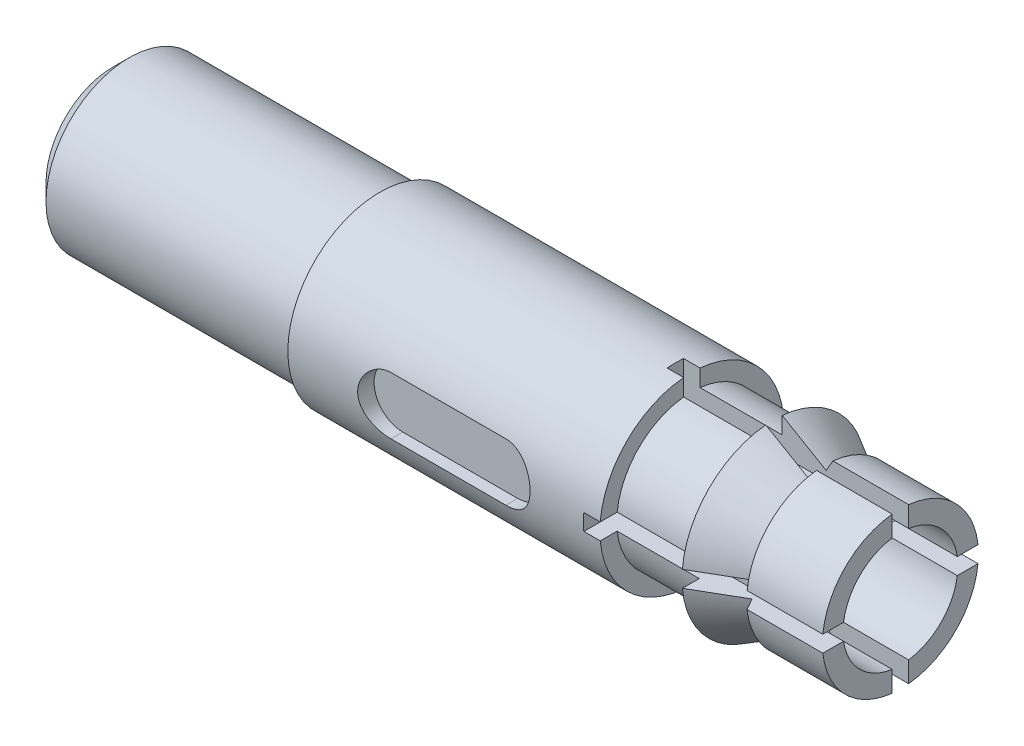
ISO-10303-21;
HEADER;
FILE_DESCRIPTION(('STEP AP214'),'2;1');
FILE_NAME('part.step','',(''),(''),'','','');
FILE_SCHEMA(('AUTOMOTIVE_DESIGN { 1 0 10303 214 1 1 1 1 }'));
ENDSEC;
DATA;
#1=APPLICATION_CONTEXT('core data for automotive mechanical design processes');
#2=APPLICATION_PROTOCOL_DEFINITION('international standard','automotive_design',2000,#1);
#3=PRODUCT_CONTEXT('',#1,'mechanical');
#4=PRODUCT('Part','Part','',(#3));
#5=PRODUCT_RELATED_PRODUCT_CATEGORY('part','',(#4));
#6=PRODUCT_DEFINITION_FORMATION('','',#4);
#7=PRODUCT_DEFINITION_CONTEXT('part definition',#1,'design');
#8=PRODUCT_DEFINITION('design','',#6,#7);
#9=PRODUCT_DEFINITION_SHAPE('','',#8);
#10=(LENGTH_UNIT() NAMED_UNIT(*) SI_UNIT(.MILLI.,.METRE.));
#11=(NAMED_UNIT(*) PLANE_ANGLE_UNIT() SI_UNIT($,.RADIAN.));
#12=(NAMED_UNIT(*) SI_UNIT($,.STERADIAN.) SOLID_ANGLE_UNIT());
#13=UNCERTAINTY_MEASURE_WITH_UNIT(LENGTH_MEASURE(1.E-05),#10,'distance_accuracy_value','');
#14=(GEOMETRIC_REPRESENTATION_CONTEXT(3) GLOBAL_UNCERTAINTY_ASSIGNED_CONTEXT((#13)) GLOBAL_UNIT_ASSIGNED_CONTEXT((#10,
#11,#12)) REPRESENTATION_CONTEXT('',''));
#15=CARTESIAN_POINT('',(0.,0.,0.));
#16=DIRECTION('',(0.,0.,1.));
#17=DIRECTION('',(1.,0.,0.));
#18=AXIS2_PLACEMENT_3D('',#15,#16,#17);
#19=CARTESIAN_POINT('',(23.975,0.,0.));
#20=DIRECTION('',(1.,0.,0.));
#21=DIRECTION('',(0.,0.,-1.));
#22=AXIS2_PLACEMENT_3D('',#19,#20,#21);
#23=PLANE('',#22);
#24=DIRECTION('',(0.,0.,-1.));
#25=VECTOR('',#24,1.);
#26=CARTESIAN_POINT('',(23.975,-0.49999999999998,-5.6));
#27=LINE('',#26,#25);
#28=CARTESIAN_POINT('',(23.975,-0.500000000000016,4.72361090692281));
#29=VERTEX_POINT('',#28);
#30=CARTESIAN_POINT('',(23.975,-0.500000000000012,3.46410161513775));
#31=VERTEX_POINT('',#30);
#32=EDGE_CURVE('E378',#29,#31,#27,.T.);
#33=ORIENTED_EDGE('',*,*,#32,.F.);
#34=CARTESIAN_POINT('',(23.975,0.,0.));
#35=DIRECTION('',(-1.,0.,0.));
#36=DIRECTION('',(0.,0.,1.));
#37=AXIS2_PLACEMENT_3D('',#34,#35,#36);
#38=CIRCLE('',#37,4.75000000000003);
#39=CARTESIAN_POINT('',(23.975,-4.72361090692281,0.5));
#40=VERTEX_POINT('',#39);
#41=EDGE_CURVE('E746',#40,#29,#38,.T.);
#42=ORIENTED_EDGE('',*,*,#41,.F.);
#43=DIRECTION('',(0.,-1.,0.));
#44=VECTOR('',#43,1.);
#45=CARTESIAN_POINT('',(23.975,-5.6,0.5));
#46=LINE('',#45,#44);
#47=CARTESIAN_POINT('',(23.975,-3.46410161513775,0.5));
#48=VERTEX_POINT('',#47);
#49=EDGE_CURVE('E517',#48,#40,#46,.T.);
#50=ORIENTED_EDGE('',*,*,#49,.F.);
#51=CARTESIAN_POINT('',(23.975,0.,0.));
#52=DIRECTION('',(-1.,0.,0.));
#53=DIRECTION('',(0.,0.,1.));
#54=AXIS2_PLACEMENT_3D('',#51,#52,#53);
#55=CIRCLE('',#54,3.5);
#56=EDGE_CURVE('E760',#48,#31,#55,.T.);
#57=ORIENTED_EDGE('',*,*,#56,.T.);
#58=EDGE_LOOP('',(#33,#42,#50,#57));
#59=FACE_BOUND('',#58,.T.);
#60=ADVANCED_FACE('F51',(#59),#23,.T.);
#61=CARTESIAN_POINT('',(-23.975,0.,0.));
#62=DIRECTION('',(-1.,0.,0.));
#63=DIRECTION('',(0.,0.,1.));
#64=AXIS2_PLACEMENT_3D('',#61,#62,#63);
#65=CYLINDRICAL_SURFACE('',#64,4.75000000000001);
#66=DIRECTION('',(-1.,0.,0.));
#67=VECTOR('',#66,1.);
#68=CARTESIAN_POINT('',(-23.975,-0.500000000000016,4.72361090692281));
#69=LINE('',#68,#67);
#70=CARTESIAN_POINT('',(19.3638239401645,-0.500000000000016,4.72361090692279));
#71=VERTEX_POINT('',#70);
#72=EDGE_CURVE('E509',#71,#29,#69,.F.);
#73=ORIENTED_EDGE('',*,*,#72,.F.);
#74=CARTESIAN_POINT('',(19.3638239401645,0.,0.));
#75=DIRECTION('',(-1.,0.,0.));
#76=DIRECTION('',(0.,0.,1.));
#77=AXIS2_PLACEMENT_3D('',#74,#75,#76);
#78=CIRCLE('',#77,4.75);
#79=CARTESIAN_POINT('',(19.3638239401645,-4.72361090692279,0.5));
#80=VERTEX_POINT('',#79);
#81=EDGE_CURVE('E736',#80,#71,#78,.T.);
#82=ORIENTED_EDGE('',*,*,#81,.F.);
#83=DIRECTION('',(-1.,0.,0.));
#84=VECTOR('',#83,1.);
#85=CARTESIAN_POINT('',(-23.975,-4.72361090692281,0.5));
#86=LINE('',#85,#84);
#87=EDGE_CURVE('E721',#40,#80,#86,.T.);
#88=ORIENTED_EDGE('',*,*,#87,.F.);
#89=ORIENTED_EDGE('',*,*,#41,.T.);
#90=EDGE_LOOP('',(#73,#82,#88,#89));
#91=FACE_BOUND('',#90,.T.);
#92=ADVANCED_FACE('F837',(#91),#65,.T.);
#93=CARTESIAN_POINT('',(18.9596787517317,0.,0.));
#94=DIRECTION('',(1.,0.,0.));
#95=DIRECTION('',(0.,0.,-1.));
#96=AXIS2_PLACEMENT_3D('',#93,#94,#95);
#97=CONICAL_SURFACE('',#96,4.05,1.0471975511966);
#98=CARTESIAN_POINT('',(16.9100855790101,-0.5,-0.000700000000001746));
#99=CARTESIAN_POINT('',(16.9100147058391,-0.5,0.0281536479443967));
#100=CARTESIAN_POINT('',(16.9114820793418,-0.5,0.0569726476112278));
#101=CARTESIAN_POINT('',(16.9170887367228,-0.5,0.114232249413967));
#102=CARTESIAN_POINT('',(16.9212166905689,-0.5,0.142673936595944));
#103=CARTESIAN_POINT('',(16.9316972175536,-0.500000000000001,0.198855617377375));
#104=CARTESIAN_POINT('',(16.9380288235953,-0.500000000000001,0.226599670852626));
#105=CARTESIAN_POINT('',(16.9524338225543,-0.500000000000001,0.281653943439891));
#106=CARTESIAN_POINT('',(16.9605090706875,-0.500000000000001,0.308963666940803));
#107=CARTESIAN_POINT('',(16.9876788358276,-0.500000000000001,0.393379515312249));
#108=CARTESIAN_POINT('',(17.0090194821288,-0.500000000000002,0.449752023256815));
#109=CARTESIAN_POINT('',(17.0547973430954,-0.500000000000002,0.561240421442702));
#110=CARTESIAN_POINT('',(17.0792382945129,-0.500000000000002,0.616354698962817));
#111=CARTESIAN_POINT('',(17.1299533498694,-0.500000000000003,0.725889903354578));
#112=CARTESIAN_POINT('',(17.1562317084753,-0.500000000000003,0.780308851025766));
#113=CARTESIAN_POINT('',(17.2098716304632,-0.500000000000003,0.888611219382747));
#114=CARTESIAN_POINT('',(17.23723330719,-0.500000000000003,0.942494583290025));
#115=CARTESIAN_POINT('',(17.2933970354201,-0.500000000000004,1.05133697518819));
#116=CARTESIAN_POINT('',(17.3222180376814,-0.500000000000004,1.10628619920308));
#117=CARTESIAN_POINT('',(17.3803601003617,-0.500000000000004,1.21592796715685));
#118=CARTESIAN_POINT('',(17.4096812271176,-0.500000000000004,1.27062047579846));
#119=CARTESIAN_POINT('',(17.4980480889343,-0.500000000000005,1.43421840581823));
#120=CARTESIAN_POINT('',(17.5576040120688,-0.500000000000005,1.54284783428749));
#121=CARTESIAN_POINT('',(17.6910649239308,-0.500000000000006,1.78436264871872));
#122=CARTESIAN_POINT('',(17.7651530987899,-0.500000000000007,1.91714631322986));
#123=CARTESIAN_POINT('',(17.9139293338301,-0.500000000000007,2.18238039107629));
#124=CARTESIAN_POINT('',(17.9886174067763,-0.500000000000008,2.31483079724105));
#125=CARTESIAN_POINT('',(18.2133207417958,-0.500000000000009,2.71208656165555));
#126=CARTESIAN_POINT('',(18.3638620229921,-0.50000000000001,2.97659402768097));
#127=CARTESIAN_POINT('',(18.6560061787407,-0.500000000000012,3.48856555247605));
#128=CARTESIAN_POINT('',(18.7975727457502,-0.500000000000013,3.73605038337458));
#129=CARTESIAN_POINT('',(19.0809147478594,-0.500000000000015,4.2306446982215));
#130=CARTESIAN_POINT('',(19.2226899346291,-0.500000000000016,4.47775432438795));
#131=CARTESIAN_POINT('',(19.3645239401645,-0.500000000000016,4.72483011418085));
#132=B_SPLINE_CURVE_WITH_KNOTS('',3,(#98,#99,#100,#101,#102,#103,#104,#105,#106,#107,#108,#109,
#110,#111,#112,#113,#114,#115,#116,#117,#118,#119,#120,#121,#122,#123,#124,#125,#126,#127,#128,
#129,#130,#131),.UNSPECIFIED.,.F.,.F.,(4,2,2,2,2,2,2,2,2,2,2,2,2,2,2,2,4),(0.,
0.0864654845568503,0.172565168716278,0.257867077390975,0.343260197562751,0.523878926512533,
0.704717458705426,0.88598956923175,1.06728069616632,1.25342347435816,1.43959113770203,
1.81123691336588,2.26739812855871,2.72356907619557,3.63660662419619,4.49194772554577,
5.34662308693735),.UNSPECIFIED.);
#133=CARTESIAN_POINT('',(18.9596787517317,-0.500000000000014,4.01901729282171));
#134=VERTEX_POINT('',#133);
#135=EDGE_CURVE('E503',#134,#71,#132,.T.);
#136=ORIENTED_EDGE('',*,*,#135,.F.);
#137=CARTESIAN_POINT('',(18.9596787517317,0.,0.));
#138=DIRECTION('',(-1.,0.,0.));
#139=DIRECTION('',(0.,0.,1.));
#140=AXIS2_PLACEMENT_3D('',#137,#138,#139);
#141=CIRCLE('',#140,4.05);
#142=CARTESIAN_POINT('',(18.9596787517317,-4.01901729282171,0.5));
#143=VERTEX_POINT('',#142);
#144=EDGE_CURVE('E615',#143,#134,#141,.T.);
#145=ORIENTED_EDGE('',*,*,#144,.F.);
#146=CARTESIAN_POINT('',(19.3645239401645,-4.72483011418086,0.5));
#147=CARTESIAN_POINT('',(19.2496915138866,-4.52480416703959,0.5));
#148=CARTESIAN_POINT('',(19.1349040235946,-4.32475227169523,0.5));
#149=CARTESIAN_POINT('',(18.9055125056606,-3.9245378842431,0.5));
#150=CARTESIAN_POINT('',(18.7909084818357,-3.72437538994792,0.5));
#151=CARTESIAN_POINT('',(18.5615155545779,-3.32307294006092,0.5));
#152=CARTESIAN_POINT('',(18.4467278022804,-3.12193232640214,0.5));
#153=CARTESIAN_POINT('',(18.2176376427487,-2.71937857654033,0.5));
#154=CARTESIAN_POINT('',(18.1033352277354,-2.51796544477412,0.5));
#155=CARTESIAN_POINT('',(17.9328290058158,-2.21582778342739,0.5));
#156=CARTESIAN_POINT('',(17.8762611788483,-2.11530878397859,0.5));
#157=CARTESIAN_POINT('',(17.7634897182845,-1.91406195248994,0.5));
#158=CARTESIAN_POINT('',(17.7072860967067,-1.81333411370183,0.5));
#159=CARTESIAN_POINT('',(17.5955910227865,-1.61179391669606,0.5));
#160=CARTESIAN_POINT('',(17.5400982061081,-1.51098231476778,0.5));
#161=CARTESIAN_POINT('',(17.4300872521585,-1.30883521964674,0.5));
#162=CARTESIAN_POINT('',(17.3755690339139,-1.2074997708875,0.5));
#163=CARTESIAN_POINT('',(17.2946560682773,-1.05367274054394,0.5));
#164=CARTESIAN_POINT('',(17.2675575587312,-1.00155220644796,0.5));
#165=CARTESIAN_POINT('',(17.2141043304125,-0.896916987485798,0.5));
#166=CARTESIAN_POINT('',(17.1877497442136,-0.84440223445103,0.5));
#167=CARTESIAN_POINT('',(17.1360446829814,-0.738479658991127,0.5));
#168=CARTESIAN_POINT('',(17.1107013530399,-0.685068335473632,0.5));
#169=CARTESIAN_POINT('',(17.0619480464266,-0.57736832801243,0.5));
#170=CARTESIAN_POINT('',(17.0385374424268,-0.523079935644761,0.5));
#171=CARTESIAN_POINT('',(17.0046709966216,-0.437225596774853,0.5));
#172=CARTESIAN_POINT('',(16.9930345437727,-0.406129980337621,0.5));
#173=CARTESIAN_POINT('',(16.97130554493,-0.343384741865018,0.5));
#174=CARTESIAN_POINT('',(16.9612134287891,-0.3117349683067,0.5));
#175=CARTESIAN_POINT('',(16.9433126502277,-0.248232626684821,0.5));
#176=CARTESIAN_POINT('',(16.9354755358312,-0.216388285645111,0.5));
#177=CARTESIAN_POINT('',(16.9226537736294,-0.152143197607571,0.5));
#178=CARTESIAN_POINT('',(16.9176661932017,-0.119743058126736,0.5));
#179=CARTESIAN_POINT('',(16.9111408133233,-0.0538698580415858,0.5));
#180=CARTESIAN_POINT('',(16.9096800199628,-0.0203887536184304,0.5));
#181=CARTESIAN_POINT('',(16.910687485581,0.0465085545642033,0.5));
#182=CARTESIAN_POINT('',(16.9131555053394,0.0799247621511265,0.5));
#183=CARTESIAN_POINT('',(16.9216580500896,0.146720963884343,0.5));
#184=CARTESIAN_POINT('',(16.9277386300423,0.180094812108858,0.5));
#185=CARTESIAN_POINT('',(16.9427053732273,0.246208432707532,0.5));
#186=CARTESIAN_POINT('',(16.9515935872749,0.278947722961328,0.5));
#187=CARTESIAN_POINT('',(16.9772157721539,0.362938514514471,0.5));
#188=CARTESIAN_POINT('',(16.995484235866,0.413711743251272,0.5));
#189=CARTESIAN_POINT('',(17.0349262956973,0.514132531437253,0.5));
#190=CARTESIAN_POINT('',(17.0561031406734,0.563778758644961,0.5));
#191=CARTESIAN_POINT('',(17.1002310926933,0.66240352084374,0.5));
#192=CARTESIAN_POINT('',(17.1231860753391,0.711380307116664,0.5));
#193=CARTESIAN_POINT('',(17.1701864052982,0.808810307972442,0.5));
#194=CARTESIAN_POINT('',(17.1942318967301,0.857263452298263,0.5));
#195=CARTESIAN_POINT('',(17.2678036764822,1.00285983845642,0.5));
#196=CARTESIAN_POINT('',(17.3183993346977,1.0994603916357,0.5));
#197=CARTESIAN_POINT('',(17.4208543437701,1.29176075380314,0.5));
#198=CARTESIAN_POINT('',(17.4727113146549,1.38746184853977,0.5));
#199=CARTESIAN_POINT('',(17.6008672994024,1.62173070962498,0.5));
#200=CARTESIAN_POINT('',(17.6775907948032,1.76006620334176,0.5));
#201=CARTESIAN_POINT('',(17.8318267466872,2.03629901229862,0.5));
#202=CARTESIAN_POINT('',(17.9093392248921,2.17419631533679,0.5));
#203=CARTESIAN_POINT('',(18.064886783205,2.44984207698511,0.5));
#204=CARTESIAN_POINT('',(18.1429222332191,2.58759032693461,0.5));
#205=CARTESIAN_POINT('',(18.2992779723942,2.86292294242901,0.5));
#206=CARTESIAN_POINT('',(18.3775982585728,3.00050730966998,0.5));
#207=CARTESIAN_POINT('',(18.607016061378,3.40288992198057,0.5));
#208=CARTESIAN_POINT('',(18.7583654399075,3.66754454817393,0.5));
#209=CARTESIAN_POINT('',(18.9855863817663,4.06426448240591,0.5));
#210=CARTESIAN_POINT('',(19.061327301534,4.19640473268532,0.5));
#211=CARTESIAN_POINT('',(19.2128781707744,4.46064497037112,0.5));
#212=CARTESIAN_POINT('',(19.288688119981,4.59274495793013,0.5));
#213=CARTESIAN_POINT('',(19.3645239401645,4.72483011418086,0.5));
#214=B_SPLINE_CURVE_WITH_KNOTS('',3,(#146,#147,#148,#149,#150,#151,#152,#153,#154,#155,#156,
#157,#158,#159,#160,#161,#162,#163,#164,#165,#166,#167,#168,#169,#170,#171,#172,#173,#174,#175,
#176,#177,#178,#179,#180,#181,#182,#183,#184,#185,#186,#187,#188,#189,#190,#191,#192,#193,#194,
#195,#196,#197,#198,#199,#200,#201,#202,#203,#204,#205,#206,#207,#208,#209,#210,#211,#212,#213),
.UNSPECIFIED.,.F.,.F.,(4,2,2,2,2,2,2,2,2,2,2,2,2,2,2,2,2,2,2,2,2,2,2,2,2,2,2,2,2,2,2,2,2,4),(0.,
0.691933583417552,1.38388138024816,2.07865020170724,2.77340784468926,3.11943620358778,
3.46547592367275,3.81070158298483,4.15589842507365,4.33212752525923,4.50838783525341,
4.6857285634,4.86301150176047,4.96258844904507,5.06219306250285,5.16047949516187,
5.25866459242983,5.35897487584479,5.45927905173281,5.56089026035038,5.66257586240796,
5.82427582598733,5.98615791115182,6.14840333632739,6.31067026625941,6.63778663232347,
6.96432746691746,7.43888173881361,7.91344911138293,8.38839784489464,8.86334161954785,
9.77796558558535,10.2348896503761,10.6918119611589),.UNSPECIFIED.);
#215=EDGE_CURVE('E467',#80,#143,#214,.T.);
#216=ORIENTED_EDGE('',*,*,#215,.F.);
#217=ORIENTED_EDGE('',*,*,#81,.T.);
#218=EDGE_LOOP('',(#136,#145,#216,#217));
#219=FACE_BOUND('',#218,.T.);
#220=ADVANCED_FACE('F449',(#219),#97,.T.);
#221=CARTESIAN_POINT('',(16.275,0.,0.));
#222=DIRECTION('',(-1.,0.,0.));
#223=DIRECTION('',(0.,0.,1.));
#224=AXIS2_PLACEMENT_3D('',#221,#222,#223);
#225=CONICAL_SURFACE('',#224,5.6,0.523598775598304);
#226=CARTESIAN_POINT('',(10.5113374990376,-0.500000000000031,8.91363965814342));
#227=CARTESIAN_POINT('',(10.9407803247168,-0.50000000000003,8.66530955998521));
#228=CARTESIAN_POINT('',(11.3702102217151,-0.500000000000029,8.41695708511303));
#229=CARTESIAN_POINT('',(12.2290331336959,-0.500000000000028,7.920188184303));
#230=CARTESIAN_POINT('',(12.6584261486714,-0.500000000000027,7.67177175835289));
#231=CARTESIAN_POINT('',(13.9464619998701,-0.500000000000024,6.92643903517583));
#232=CARTESIAN_POINT('',(14.8050327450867,-0.500000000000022,6.42939818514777));
#233=CARTESIAN_POINT('',(16.5215778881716,-0.500000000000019,5.43485718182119));
#234=CARTESIAN_POINT('',(17.3795523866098,-0.500000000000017,4.9373572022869));
#235=CARTESIAN_POINT('',(18.665902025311,-0.500000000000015,4.18997149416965));
#236=CARTESIAN_POINT('',(19.0946010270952,-0.500000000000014,3.94064324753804));
#237=CARTESIAN_POINT('',(19.951620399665,-0.500000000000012,3.44133697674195));
#238=CARTESIAN_POINT('',(20.3799407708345,-0.500000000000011,3.19135895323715));
#239=CARTESIAN_POINT('',(20.9733753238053,-0.50000000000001,2.84381491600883));
#240=CARTESIAN_POINT('',(21.1388110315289,-0.50000000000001,2.74679806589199));
#241=CARTESIAN_POINT('',(21.4695195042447,-0.500000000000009,2.55249521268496));
#242=CARTESIAN_POINT('',(21.6347922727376,-0.500000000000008,2.45520921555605));
#243=CARTESIAN_POINT('',(21.9650822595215,-0.500000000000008,2.26027517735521));
#244=CARTESIAN_POINT('',(22.1300995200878,-0.500000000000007,2.16262720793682));
#245=CARTESIAN_POINT('',(22.4598150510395,-0.500000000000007,1.9667667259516));
#246=CARTESIAN_POINT('',(22.6245132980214,-0.500000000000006,1.86855417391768));
#247=CARTESIAN_POINT('',(22.8712120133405,-0.500000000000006,1.72054561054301));
#248=CARTESIAN_POINT('',(22.9534106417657,-0.500000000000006,1.67107999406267));
#249=CARTESIAN_POINT('',(23.117632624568,-0.500000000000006,1.5718616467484));
#250=CARTESIAN_POINT('',(23.1996559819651,-0.500000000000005,1.52210892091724));
#251=CARTESIAN_POINT('',(23.3634533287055,-0.500000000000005,1.42223509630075));
#252=CARTESIAN_POINT('',(23.4452273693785,-0.500000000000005,1.37211408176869));
#253=CARTESIAN_POINT('',(23.6084628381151,-0.500000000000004,1.27135301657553));
#254=CARTESIAN_POINT('',(23.6899242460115,-0.500000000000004,1.22071293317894));
#255=CARTESIAN_POINT('',(23.8524570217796,-0.500000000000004,1.11866133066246));
#256=CARTESIAN_POINT('',(23.9335280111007,-0.500000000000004,1.06724920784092));
#257=CARTESIAN_POINT('',(24.0949684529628,-0.500000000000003,0.963358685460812));
#258=CARTESIAN_POINT('',(24.1753380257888,-0.500000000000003,0.910880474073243));
#259=CARTESIAN_POINT('',(24.2950711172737,-0.500000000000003,0.830855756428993));
#260=CARTESIAN_POINT('',(24.3348626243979,-0.500000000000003,0.803950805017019));
#261=CARTESIAN_POINT('',(24.4140534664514,-0.500000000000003,0.749576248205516));
#262=CARTESIAN_POINT('',(24.4534528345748,-0.500000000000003,0.722106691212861));
#263=CARTESIAN_POINT('',(24.5317506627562,-0.500000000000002,0.666406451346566));
#264=CARTESIAN_POINT('',(24.5706488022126,-0.500000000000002,0.638175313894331));
#265=CARTESIAN_POINT('',(24.6476574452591,-0.500000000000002,0.580638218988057));
#266=CARTESIAN_POINT('',(24.6857677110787,-0.500000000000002,0.551331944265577));
#267=CARTESIAN_POINT('',(24.7233412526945,-0.500000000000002,0.5213314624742));
#268=B_SPLINE_CURVE_WITH_KNOTS('',3,(#226,#227,#228,#229,#230,#231,#232,#233,#234,#235,#236,
#237,#238,#239,#240,#241,#242,#243,#244,#245,#246,#247,#248,#249,#250,#251,#252,#253,#254,#255,
#256,#257,#258,#259,#260,#261,#262,#263,#264,#265,#266,#267),.UNSPECIFIED.,.F.,.F.,(4,2,2,2,2,2,
2,2,2,2,2,2,2,2,2,2,2,2,2,2,4),(0.,1.48822070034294,2.97644168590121,5.95263726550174,
8.9279746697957,10.4157670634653,11.90355794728,12.4789108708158,13.0542511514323,
13.6294830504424,14.2047556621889,14.4925592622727,14.7803578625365,15.0680925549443,
15.355845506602,15.6438365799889,15.9317772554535,16.0758746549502,16.2199597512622,
16.3641328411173,16.5083488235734),.UNSPECIFIED.);
#269=CARTESIAN_POINT('',(16.275,-0.500000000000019,5.57763390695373));
#270=VERTEX_POINT('',#269);
#271=EDGE_CURVE('E498',#270,#134,#268,.T.);
#272=ORIENTED_EDGE('',*,*,#271,.F.);
#273=CARTESIAN_POINT('',(16.275,0.,0.));
#274=DIRECTION('',(-1.,0.,0.));
#275=DIRECTION('',(0.,0.,1.));
#276=AXIS2_PLACEMENT_3D('',#273,#274,#275);
#277=CIRCLE('',#276,5.6);
#278=CARTESIAN_POINT('',(16.275,-5.57763390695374,0.5));
#279=VERTEX_POINT('',#278);
#280=EDGE_CURVE('E630',#279,#270,#277,.T.);
#281=ORIENTED_EDGE('',*,*,#280,.F.);
#282=CARTESIAN_POINT('',(16.2743,5.57803967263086,0.5));
#283=CARTESIAN_POINT('',(16.5494701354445,5.41853045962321,0.5));
#284=CARTESIAN_POINT('',(16.8246188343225,5.25898423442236,0.5));
#285=CARTESIAN_POINT('',(17.3748541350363,4.93978384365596,0.5));
#286=CARTESIAN_POINT('',(17.6499407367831,4.78012967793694,0.5));
#287=CARTESIAN_POINT('',(18.2001134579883,4.46063254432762,0.5));
#288=CARTESIAN_POINT('',(18.4751995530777,4.30078953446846,0.5));
#289=CARTESIAN_POINT('',(19.025257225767,3.98090728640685,0.5));
#290=CARTESIAN_POINT('',(19.3002288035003,3.82086804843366,0.5));
#291=CARTESIAN_POINT('',(19.8379568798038,3.50752815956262,0.5));
#292=CARTESIAN_POINT('',(20.1007204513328,3.35423964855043,0.5));
#293=CARTESIAN_POINT('',(20.6260246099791,3.04727869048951,0.5));
#294=CARTESIAN_POINT('',(20.8885651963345,2.89360624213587,0.5));
#295=CARTESIAN_POINT('',(21.4132209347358,2.58569231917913,0.5));
#296=CARTESIAN_POINT('',(21.675336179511,2.43145100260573,0.5));
#297=CARTESIAN_POINT('',(22.1989622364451,2.12194720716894,0.5));
#298=CARTESIAN_POINT('',(22.4604730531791,1.96668473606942,0.5));
#299=CARTESIAN_POINT('',(22.8532640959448,1.73140685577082,0.5));
#300=CARTESIAN_POINT('',(22.984996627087,1.65214778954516,0.5));
#301=CARTESIAN_POINT('',(23.2480448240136,1.49278614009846,0.5));
#302=CARTESIAN_POINT('',(23.3793602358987,1.41268313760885,0.5));
#303=CARTESIAN_POINT('',(23.6435070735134,1.2498019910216,0.5));
#304=CARTESIAN_POINT('',(23.7763248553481,1.16700156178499,0.5));
#305=CARTESIAN_POINT('',(23.9743208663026,1.04108226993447,0.5));
#306=CARTESIAN_POINT('',(24.0400653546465,0.998855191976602,0.5));
#307=CARTESIAN_POINT('',(24.170999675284,0.913553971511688,0.5));
#308=CARTESIAN_POINT('',(24.2361895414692,0.870479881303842,0.5));
#309=CARTESIAN_POINT('',(24.3658984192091,0.782962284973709,0.5));
#310=CARTESIAN_POINT('',(24.430415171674,0.738515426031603,0.5));
#311=CARTESIAN_POINT('',(24.5583539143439,0.64746007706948,0.5));
#312=CARTESIAN_POINT('',(24.6217699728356,0.6008430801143,0.5));
#313=CARTESIAN_POINT('',(24.7143250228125,0.528754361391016,0.5));
#314=CARTESIAN_POINT('',(24.7444824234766,0.504596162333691,0.5));
#315=CARTESIAN_POINT('',(24.8038259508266,0.455121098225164,0.5));
#316=CARTESIAN_POINT('',(24.8330124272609,0.429804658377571,0.5));
#317=CARTESIAN_POINT('',(24.8897016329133,0.377704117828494,0.5));
#318=CARTESIAN_POINT('',(24.9172141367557,0.350930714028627,0.5));
#319=CARTESIAN_POINT('',(24.9697403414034,0.295057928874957,0.5));
#320=CARTESIAN_POINT('',(24.9947605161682,0.265964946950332,0.5));
#321=CARTESIAN_POINT('',(25.0243956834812,0.225743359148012,0.5));
#322=CARTESIAN_POINT('',(25.0311129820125,0.216172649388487,0.5));
#323=CARTESIAN_POINT('',(25.0440056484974,0.196669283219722,0.5));
#324=CARTESIAN_POINT('',(25.0501807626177,0.186736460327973,0.5));
#325=CARTESIAN_POINT('',(25.0676820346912,0.156396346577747,0.5));
#326=CARTESIAN_POINT('',(25.0780294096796,0.135388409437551,0.5));
#327=CARTESIAN_POINT('',(25.0926744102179,0.0972145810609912,0.5));
#328=CARTESIAN_POINT('',(25.0978357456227,0.0803863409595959,0.5));
#329=CARTESIAN_POINT('',(25.1052833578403,0.0460942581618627,0.5));
#330=CARTESIAN_POINT('',(25.1075723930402,0.0286310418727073,0.5));
#331=CARTESIAN_POINT('',(25.108921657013,-0.00649801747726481,0.5));
#332=CARTESIAN_POINT('',(25.1079684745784,-0.0241644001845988,0.5));
#333=CARTESIAN_POINT('',(25.1029637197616,-0.0590463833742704,0.5));
#334=CARTESIAN_POINT('',(25.098909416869,-0.0762615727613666,0.5));
#335=CARTESIAN_POINT('',(25.0862377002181,-0.11625540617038,0.5));
#336=CARTESIAN_POINT('',(25.0764714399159,-0.138660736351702,0.5));
#337=CARTESIAN_POINT('',(25.0537027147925,-0.181763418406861,0.5));
#338=CARTESIAN_POINT('',(25.0406890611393,-0.202454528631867,0.5));
#339=CARTESIAN_POINT('',(25.0058920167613,-0.251900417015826,0.5));
#340=CARTESIAN_POINT('',(24.9828906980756,-0.279780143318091,0.5));
#341=CARTESIAN_POINT('',(24.9344065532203,-0.333324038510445,0.5));
#342=CARTESIAN_POINT('',(24.9089173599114,-0.358982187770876,0.5));
#343=CARTESIAN_POINT('',(24.8562642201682,-0.408899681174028,0.5));
#344=CARTESIAN_POINT('',(24.8290894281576,-0.433147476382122,0.5));
#345=CARTESIAN_POINT('',(24.773806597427,-0.480464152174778,0.5));
#346=CARTESIAN_POINT('',(24.7456998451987,-0.503534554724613,0.5));
#347=CARTESIAN_POINT('',(24.6843175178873,-0.552422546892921,0.5));
#348=CARTESIAN_POINT('',(24.6509282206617,-0.578096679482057,0.5));
#349=CARTESIAN_POINT('',(24.5835343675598,-0.628626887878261,0.5));
#350=CARTESIAN_POINT('',(24.5495297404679,-0.65348286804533,0.5));
#351=CARTESIAN_POINT('',(24.4468380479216,-0.727159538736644,0.5));
#352=CARTESIAN_POINT('',(24.3774989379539,-0.775069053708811,0.5));
#353=CARTESIAN_POINT('',(24.2377235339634,-0.869504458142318,0.5));
#354=CARTESIAN_POINT('',(24.1672855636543,-0.916027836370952,0.5));
#355=CARTESIAN_POINT('',(24.0257943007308,-1.00809131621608,0.5));
#356=CARTESIAN_POINT('',(23.9547411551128,-1.05363164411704,0.5));
#357=CARTESIAN_POINT('',(23.8125304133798,-1.14383612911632,0.5));
#358=CARTESIAN_POINT('',(23.7413747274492,-1.18850330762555,0.5));
#359=CARTESIAN_POINT('',(23.598757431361,-1.27735539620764,0.5));
#360=CARTESIAN_POINT('',(23.5272958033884,-1.32154027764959,0.5));
#361=CARTESIAN_POINT('',(23.3127207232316,-1.45347370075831,0.5));
#362=CARTESIAN_POINT('',(23.1692789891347,-1.54068783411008,0.5));
#363=CARTESIAN_POINT('',(22.8862324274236,-1.71163679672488,0.5));
#364=CARTESIAN_POINT('',(22.746642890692,-1.79539703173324,0.5));
#365=CARTESIAN_POINT('',(22.4671431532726,-1.96238112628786,0.5));
#366=CARTESIAN_POINT('',(22.327232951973,-2.04560498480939,0.5));
#367=CARTESIAN_POINT('',(21.9071735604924,-2.29473344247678,0.5));
#368=CARTESIAN_POINT('',(21.6267007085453,-2.46009184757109,0.5));
#369=CARTESIAN_POINT('',(21.0651680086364,-2.79011152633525,0.5));
#370=CARTESIAN_POINT('',(20.7841079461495,-2.95477243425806,0.5));
#371=CARTESIAN_POINT('',(20.2217120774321,-3.28361706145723,0.5));
#372=CARTESIAN_POINT('',(19.9403762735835,-3.44780078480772,0.5));
#373=CARTESIAN_POINT('',(19.3770600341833,-3.77613210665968,0.5));
#374=CARTESIAN_POINT('',(19.0950793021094,-3.94027919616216,0.5));
#375=CARTESIAN_POINT('',(18.5309936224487,-4.26836164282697,0.5));
#376=CARTESIAN_POINT('',(18.2488886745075,-4.4322969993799,0.5));
#377=CARTESIAN_POINT('',(17.6847394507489,-4.75993060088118,0.5));
#378=CARTESIAN_POINT('',(17.4026952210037,-4.92362892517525,0.5));
#379=CARTESIAN_POINT('',(16.8385414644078,-5.25091095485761,0.5));
#380=CARTESIAN_POINT('',(16.5564319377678,-5.41449466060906,0.5));
#381=CARTESIAN_POINT('',(16.2743,-5.57803967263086,0.5));
#382=B_SPLINE_CURVE_WITH_KNOTS('',3,(#282,#283,#284,#285,#286,#287,#288,#289,#290,#291,#292,
#293,#294,#295,#296,#297,#298,#299,#300,#301,#302,#303,#304,#305,#306,#307,#308,#309,#310,#311,
#312,#313,#314,#315,#316,#317,#318,#319,#320,#321,#322,#323,#324,#325,#326,#327,#328,#329,#330,
#331,#332,#333,#334,#335,#336,#337,#338,#339,#340,#341,#342,#343,#344,#345,#346,#347,#348,#349,
#350,#351,#352,#353,#354,#355,#356,#357,#358,#359,#360,#361,#362,#363,#364,#365,#366,#367,#368,
#369,#370,#371,#372,#373,#374,#375,#376,#377,#378,#379,#380,#381),.UNSPECIFIED.,.F.,.F.,(4,2,2,
2,2,2,2,2,2,2,2,2,2,2,2,2,2,2,2,2,2,2,2,2,2,2,2,2,2,2,2,2,2,2,2,2,2,2,2,2,2,2,2,2,2,2,2,2,2,4),
(0.,0.954178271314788,1.90835790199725,2.86282069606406,3.81728237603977,4.72990401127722,
5.6425287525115,6.55491664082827,7.46729760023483,7.92851032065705,8.38996412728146,
8.85948719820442,9.09389577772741,9.32828992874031,9.56331064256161,9.7993464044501,
9.9152499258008,10.0311112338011,10.1462138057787,10.2610091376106,10.2960702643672,
10.3311477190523,10.4010807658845,10.453687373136,10.5062434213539,10.5590171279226,
10.6118373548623,10.684740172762,10.7578977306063,10.866036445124,10.9744595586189,
11.0836723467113,11.1927401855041,11.3190786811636,11.4454318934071,11.6982359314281,
11.9514731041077,12.2046513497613,12.4566898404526,12.7087432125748,13.2123606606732,
13.7007333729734,14.1891070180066,15.1658722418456,16.1430983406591,17.1203160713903,
18.0991502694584,19.07798727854,20.0563096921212,21.0346289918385),.UNSPECIFIED.);
#383=EDGE_CURVE('E562',#143,#279,#382,.T.);
#384=ORIENTED_EDGE('',*,*,#383,.F.);
#385=ORIENTED_EDGE('',*,*,#144,.T.);
#386=EDGE_LOOP('',(#272,#281,#384,#385));
#387=FACE_BOUND('',#386,.T.);
#388=ADVANCED_FACE('F900',(#387),#225,.T.);
#389=CARTESIAN_POINT('',(16.275,0.,0.));
#390=DIRECTION('',(-1.,0.,0.));
#391=DIRECTION('',(0.,0.,1.));
#392=AXIS2_PLACEMENT_3D('',#389,#390,#391);
#393=PLANE('',#392);
#394=DIRECTION('',(0.,0.,1.));
#395=VECTOR('',#394,1.);
#396=CARTESIAN_POINT('',(16.275,-0.5,0.));
#397=LINE('',#396,#395);
#398=CARTESIAN_POINT('',(16.275,-0.500000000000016,4.54759551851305));
#399=VERTEX_POINT('',#398);
#400=EDGE_CURVE('E496',#399,#270,#397,.T.);
#401=ORIENTED_EDGE('',*,*,#400,.F.);
#402=CARTESIAN_POINT('',(16.275,0.,0.));
#403=DIRECTION('',(-1.,0.,0.));
#404=DIRECTION('',(0.,0.,1.));
#405=AXIS2_PLACEMENT_3D('',#402,#403,#404);
#406=CIRCLE('',#405,4.575);
#407=CARTESIAN_POINT('',(16.275,-4.54759551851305,0.5));
#408=VERTEX_POINT('',#407);
#409=EDGE_CURVE('E650',#408,#399,#406,.T.);
#410=ORIENTED_EDGE('',*,*,#409,.F.);
#411=DIRECTION('',(0.,1.,0.));
#412=VECTOR('',#411,1.);
#413=CARTESIAN_POINT('',(16.275,0.,0.5));
#414=LINE('',#413,#412);
#415=EDGE_CURVE('E568',#279,#408,#414,.T.);
#416=ORIENTED_EDGE('',*,*,#415,.F.);
#417=ORIENTED_EDGE('',*,*,#280,.T.);
#418=EDGE_LOOP('',(#401,#410,#416,#417));
#419=FACE_BOUND('',#418,.T.);
#420=ADVANCED_FACE('F896',(#419),#393,.T.);
#421=CARTESIAN_POINT('',(-23.975,0.,0.));
#422=DIRECTION('',(-1.,0.,0.));
#423=DIRECTION('',(0.,0.,1.));
#424=AXIS2_PLACEMENT_3D('',#421,#422,#423);
#425=CYLINDRICAL_SURFACE('',#424,4.575);
#426=DIRECTION('',(-1.,0.,0.));
#427=VECTOR('',#426,1.);
#428=CARTESIAN_POINT('',(-23.975,-0.500000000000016,4.54759551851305));
#429=LINE('',#428,#427);
#430=CARTESIAN_POINT('',(11.275,-0.500000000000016,4.54759551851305));
#431=VERTEX_POINT('',#430);
#432=EDGE_CURVE('E494',#431,#399,#429,.F.);
#433=ORIENTED_EDGE('',*,*,#432,.F.);
#434=CARTESIAN_POINT('',(11.275,0.,0.));
#435=DIRECTION('',(-1.,0.,0.));
#436=DIRECTION('',(0.,0.,1.));
#437=AXIS2_PLACEMENT_3D('',#434,#435,#436);
#438=CIRCLE('',#437,4.575);
#439=CARTESIAN_POINT('',(11.275,-4.54759551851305,0.5));
#440=VERTEX_POINT('',#439);
#441=EDGE_CURVE('E670',#440,#431,#438,.T.);
#442=ORIENTED_EDGE('',*,*,#441,.F.);
#443=DIRECTION('',(-1.,0.,0.));
#444=VECTOR('',#443,1.);
#445=CARTESIAN_POINT('',(-23.975,-4.54759551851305,0.5));
#446=LINE('',#445,#444);
#447=EDGE_CURVE('E571',#408,#440,#446,.T.);
#448=ORIENTED_EDGE('',*,*,#447,.F.);
#449=ORIENTED_EDGE('',*,*,#409,.T.);
#450=EDGE_LOOP('',(#433,#442,#448,#449));
#451=FACE_BOUND('',#450,.T.);
#452=ADVANCED_FACE('F895',(#451),#425,.T.);
#453=CARTESIAN_POINT('',(11.275,0.,0.));
#454=DIRECTION('',(1.,0.,0.));
#455=DIRECTION('',(0.,0.,-1.));
#456=AXIS2_PLACEMENT_3D('',#453,#454,#455);
#457=PLANE('',#456);
#458=DIRECTION('',(0.,0.,-1.));
#459=VECTOR('',#458,1.);
#460=CARTESIAN_POINT('',(11.275,-0.5,0.));
#461=LINE('',#460,#459);
#462=CARTESIAN_POINT('',(11.275,-0.500000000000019,5.57763390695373));
#463=VERTEX_POINT('',#462);
#464=EDGE_CURVE('E492',#463,#431,#461,.T.);
#465=ORIENTED_EDGE('',*,*,#464,.F.);
#466=CARTESIAN_POINT('',(11.275,0.,0.));
#467=DIRECTION('',(-1.,0.,0.));
#468=DIRECTION('',(0.,0.,1.));
#469=AXIS2_PLACEMENT_3D('',#466,#467,#468);
#470=CIRCLE('',#469,5.6);
#471=CARTESIAN_POINT('',(11.275,-5.57763390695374,0.5));
#472=VERTEX_POINT('',#471);
#473=EDGE_CURVE('E690',#472,#463,#470,.T.);
#474=ORIENTED_EDGE('',*,*,#473,.F.);
#475=DIRECTION('',(0.,-1.,0.));
#476=VECTOR('',#475,1.);
#477=CARTESIAN_POINT('',(11.275,0.,0.5));
#478=LINE('',#477,#476);
#479=EDGE_CURVE('E574',#440,#472,#478,.T.);
#480=ORIENTED_EDGE('',*,*,#479,.F.);
#481=ORIENTED_EDGE('',*,*,#441,.T.);
#482=EDGE_LOOP('',(#465,#474,#480,#481));
#483=FACE_BOUND('',#482,.T.);
#484=ADVANCED_FACE('F849',(#483),#457,.T.);
#485=CARTESIAN_POINT('',(23.975,-0.499999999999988,-3.46410161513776));
#486=VERTEX_POINT('',#485);
#487=CARTESIAN_POINT('',(23.975,-0.499999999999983,-4.72361090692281));
#488=VERTEX_POINT('',#487);
#489=EDGE_CURVE('E364',#486,#488,#27,.T.);
#490=ORIENTED_EDGE('',*,*,#489,.F.);
#491=CARTESIAN_POINT('',(23.975,-3.46410161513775,-0.5));
#492=VERTEX_POINT('',#491);
#493=EDGE_CURVE('E761',#486,#492,#55,.T.);
#494=ORIENTED_EDGE('',*,*,#493,.T.);
#495=DIRECTION('',(0.,1.,0.));
#496=VECTOR('',#495,1.);
#497=CARTESIAN_POINT('',(23.975,-5.6,-0.5));
#498=LINE('',#497,#496);
#499=CARTESIAN_POINT('',(23.975,-4.72361090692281,-0.5));
#500=VERTEX_POINT('',#499);
#501=EDGE_CURVE('E522',#500,#492,#498,.T.);
#502=ORIENTED_EDGE('',*,*,#501,.F.);
#503=EDGE_CURVE('E747',#488,#500,#38,.T.);
#504=ORIENTED_EDGE('',*,*,#503,.F.);
#505=EDGE_LOOP('',(#490,#494,#502,#504));
#506=FACE_BOUND('',#505,.T.);
#507=ADVANCED_FACE('F839',(#506),#23,.T.);
#508=DIRECTION('',(-1.,0.,0.));
#509=VECTOR('',#508,1.);
#510=CARTESIAN_POINT('',(-23.975,-0.499999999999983,-4.72361090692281));
#511=LINE('',#510,#509);
#512=CARTESIAN_POINT('',(19.3638239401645,-0.499999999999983,-4.7236109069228));
#513=VERTEX_POINT('',#512);
#514=EDGE_CURVE('E484',#488,#513,#511,.T.);
#515=ORIENTED_EDGE('',*,*,#514,.F.);
#516=ORIENTED_EDGE('',*,*,#503,.T.);
#517=DIRECTION('',(-1.,0.,0.));
#518=VECTOR('',#517,1.);
#519=CARTESIAN_POINT('',(-23.975,-4.72361090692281,-0.5));
#520=LINE('',#519,#518);
#521=CARTESIAN_POINT('',(19.3638239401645,-4.72361090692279,-0.5));
#522=VERTEX_POINT('',#521);
#523=EDGE_CURVE('E583',#522,#500,#520,.F.);
#524=ORIENTED_EDGE('',*,*,#523,.F.);
#525=EDGE_CURVE('E737',#513,#522,#78,.T.);
#526=ORIENTED_EDGE('',*,*,#525,.F.);
#527=EDGE_LOOP('',(#515,#516,#524,#526));
#528=FACE_BOUND('',#527,.T.);
#529=ADVANCED_FACE('F845',(#528),#65,.T.);
#530=CARTESIAN_POINT('',(19.3645239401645,-0.499999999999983,-4.72483011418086));
#531=CARTESIAN_POINT('',(19.2173290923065,-0.499999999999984,-4.46840544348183));
#532=CARTESIAN_POINT('',(19.0701911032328,-0.499999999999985,-4.211948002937));
#533=CARTESIAN_POINT('',(18.7762364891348,-0.499999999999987,-3.69877887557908));
#534=CARTESIAN_POINT('',(18.6294199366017,-0.499999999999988,-3.44206714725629));
#535=CARTESIAN_POINT('',(18.3377422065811,-0.49999999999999,-2.93070029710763));
#536=CARTESIAN_POINT('',(18.1928755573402,-0.49999999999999,-2.67604830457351));
#537=CARTESIAN_POINT('',(17.9765973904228,-0.499999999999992,-2.29352020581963));
#538=CARTESIAN_POINT('',(17.9046809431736,-0.499999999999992,-2.16592985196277));
#539=CARTESIAN_POINT('',(17.7614114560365,-0.499999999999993,-1.91043405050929));
#540=CARTESIAN_POINT('',(17.6900584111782,-0.499999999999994,-1.78252860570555));
#541=CARTESIAN_POINT('',(17.5700084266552,-0.499999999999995,-1.56530383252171));
#542=CARTESIAN_POINT('',(17.5210477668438,-0.499999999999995,-1.47613072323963));
#543=CARTESIAN_POINT('',(17.423926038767,-0.499999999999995,-1.2973110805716));
#544=CARTESIAN_POINT('',(17.375765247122,-0.499999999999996,-1.20766439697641));
#545=CARTESIAN_POINT('',(17.2805275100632,-0.499999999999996,-1.02699748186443));
#546=CARTESIAN_POINT('',(17.2334602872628,-0.499999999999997,-0.93597204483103));
#547=CARTESIAN_POINT('',(17.1651080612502,-0.499999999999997,-0.798342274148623));
#548=CARTESIAN_POINT('',(17.1427044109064,-0.499999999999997,-0.752296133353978));
#549=CARTESIAN_POINT('',(17.0990529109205,-0.499999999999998,-0.659661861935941));
#550=CARTESIAN_POINT('',(17.0778048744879,-0.499999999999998,-0.613073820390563));
#551=CARTESIAN_POINT('',(17.04130072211,-0.499999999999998,-0.528709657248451));
#552=CARTESIAN_POINT('',(17.02570803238,-0.499999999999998,-0.491080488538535));
#553=CARTESIAN_POINT('',(16.9962515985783,-0.499999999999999,-0.415106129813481));
#554=CARTESIAN_POINT('',(16.9823891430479,-0.499999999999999,-0.376760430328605));
#555=CARTESIAN_POINT('',(16.9574413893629,-0.499999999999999,-0.299604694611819));
#556=CARTESIAN_POINT('',(16.9463281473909,-0.499999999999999,-0.26080392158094));
#557=CARTESIAN_POINT('',(16.9279882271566,-0.499999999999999,-0.182323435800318));
#558=CARTESIAN_POINT('',(16.9207530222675,-0.499999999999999,-0.142645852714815));
#559=CARTESIAN_POINT('',(16.91411764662,-0.5,-0.085535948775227));
#560=CARTESIAN_POINT('',(16.9126027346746,-0.5,-0.0683429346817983));
#561=CARTESIAN_POINT('',(16.9105758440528,-0.5,-0.033868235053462));
#562=CARTESIAN_POINT('',(16.9100656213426,-0.5,-0.0165864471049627));
#563=CARTESIAN_POINT('',(16.9100855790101,-0.5,0.000699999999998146));
#564=B_SPLINE_CURVE_WITH_KNOTS('',3,(#530,#531,#532,#533,#534,#535,#536,#537,#538,#539,#540,
#541,#542,#543,#544,#545,#546,#547,#548,#549,#550,#551,#552,#553,#554,#555,#556,#557,#558,#559,
#560,#561,#562,#563),.UNSPECIFIED.,.F.,.F.,(4,2,2,2,2,2,2,2,2,2,2,2,2,2,2,2,4),(0.,
0.88700594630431,1.77419472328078,2.65311546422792,3.09250232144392,3.53188529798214,
3.83707198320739,4.14236210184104,4.44975018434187,4.60336257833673,4.756950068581,
4.8791189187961,5.00137821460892,5.12233843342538,5.24303159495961,5.29478368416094,
5.34662614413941),.UNSPECIFIED.);
#565=CARTESIAN_POINT('',(18.9596787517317,-0.499999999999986,-4.01901729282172));
#566=VERTEX_POINT('',#565);
#567=EDGE_CURVE('E477',#513,#566,#564,.T.);
#568=ORIENTED_EDGE('',*,*,#567,.F.);
#569=ORIENTED_EDGE('',*,*,#525,.T.);
#570=CARTESIAN_POINT('',(19.3645239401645,4.72483011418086,-0.5));
#571=CARTESIAN_POINT('',(19.2496915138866,4.52480416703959,-0.5));
#572=CARTESIAN_POINT('',(19.1349040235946,4.32475227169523,-0.5));
#573=CARTESIAN_POINT('',(18.9055125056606,3.9245378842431,-0.5));
#574=CARTESIAN_POINT('',(18.7909084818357,3.72437538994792,-0.5));
#575=CARTESIAN_POINT('',(18.5615155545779,3.32307294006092,-0.5));
#576=CARTESIAN_POINT('',(18.4467278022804,3.12193232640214,-0.5));
#577=CARTESIAN_POINT('',(18.2176376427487,2.71937857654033,-0.5));
#578=CARTESIAN_POINT('',(18.1033352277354,2.51796544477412,-0.5));
#579=CARTESIAN_POINT('',(17.9328290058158,2.21582778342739,-0.5));
#580=CARTESIAN_POINT('',(17.8762611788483,2.11530878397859,-0.5));
#581=CARTESIAN_POINT('',(17.7634897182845,1.91406195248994,-0.5));
#582=CARTESIAN_POINT('',(17.7072860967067,1.81333411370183,-0.5));
#583=CARTESIAN_POINT('',(17.5955910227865,1.61179391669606,-0.5));
#584=CARTESIAN_POINT('',(17.5400982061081,1.51098231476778,-0.5));
#585=CARTESIAN_POINT('',(17.4300872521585,1.30883521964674,-0.5));
#586=CARTESIAN_POINT('',(17.3755690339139,1.2074997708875,-0.5));
#587=CARTESIAN_POINT('',(17.2946560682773,1.05367274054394,-0.5));
#588=CARTESIAN_POINT('',(17.2675575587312,1.00155220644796,-0.5));
#589=CARTESIAN_POINT('',(17.2141043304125,0.896916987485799,-0.5));
#590=CARTESIAN_POINT('',(17.1877497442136,0.844402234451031,-0.5));
#591=CARTESIAN_POINT('',(17.1360446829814,0.738479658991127,-0.5));
#592=CARTESIAN_POINT('',(17.1107013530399,0.685068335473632,-0.5));
#593=CARTESIAN_POINT('',(17.0619480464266,0.57736832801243,-0.5));
#594=CARTESIAN_POINT('',(17.0385374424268,0.523079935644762,-0.5));
#595=CARTESIAN_POINT('',(17.0046709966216,0.437225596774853,-0.5));
#596=CARTESIAN_POINT('',(16.9930345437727,0.406129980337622,-0.5));
#597=CARTESIAN_POINT('',(16.97130554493,0.343384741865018,-0.5));
#598=CARTESIAN_POINT('',(16.9612134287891,0.311734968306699,-0.5));
#599=CARTESIAN_POINT('',(16.9433126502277,0.24823262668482,-0.5));
#600=CARTESIAN_POINT('',(16.9354755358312,0.21638828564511,-0.5));
#601=CARTESIAN_POINT('',(16.9226537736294,0.152143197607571,-0.5));
#602=CARTESIAN_POINT('',(16.9176661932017,0.119743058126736,-0.5));
#603=CARTESIAN_POINT('',(16.9111408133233,0.053869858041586,-0.5));
#604=CARTESIAN_POINT('',(16.9096800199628,0.0203887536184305,-0.5));
#605=CARTESIAN_POINT('',(16.910687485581,-0.0465085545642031,-0.5));
#606=CARTESIAN_POINT('',(16.9131555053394,-0.0799247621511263,-0.5));
#607=CARTESIAN_POINT('',(16.9216580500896,-0.146720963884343,-0.5));
#608=CARTESIAN_POINT('',(16.9277386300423,-0.180094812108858,-0.5));
#609=CARTESIAN_POINT('',(16.9427053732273,-0.246208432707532,-0.5));
#610=CARTESIAN_POINT('',(16.9515935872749,-0.278947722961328,-0.5));
#611=CARTESIAN_POINT('',(16.9772157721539,-0.362938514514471,-0.5));
#612=CARTESIAN_POINT('',(16.995484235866,-0.413711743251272,-0.5));
#613=CARTESIAN_POINT('',(17.0349262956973,-0.514132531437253,-0.5));
#614=CARTESIAN_POINT('',(17.0561031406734,-0.563778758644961,-0.5));
#615=CARTESIAN_POINT('',(17.1002310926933,-0.66240352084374,-0.5));
#616=CARTESIAN_POINT('',(17.1231860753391,-0.711380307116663,-0.5));
#617=CARTESIAN_POINT('',(17.1701864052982,-0.808810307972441,-0.5));
#618=CARTESIAN_POINT('',(17.1942318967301,-0.857263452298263,-0.5));
#619=CARTESIAN_POINT('',(17.2678036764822,-1.00285983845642,-0.5));
#620=CARTESIAN_POINT('',(17.3183993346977,-1.0994603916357,-0.5));
#621=CARTESIAN_POINT('',(17.4208543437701,-1.29176075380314,-0.5));
#622=CARTESIAN_POINT('',(17.4727113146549,-1.38746184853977,-0.5));
#623=CARTESIAN_POINT('',(17.6008672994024,-1.62173070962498,-0.5));
#624=CARTESIAN_POINT('',(17.6775907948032,-1.76006620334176,-0.5));
#625=CARTESIAN_POINT('',(17.8318267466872,-2.03629901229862,-0.5));
#626=CARTESIAN_POINT('',(17.9093392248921,-2.17419631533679,-0.5));
#627=CARTESIAN_POINT('',(18.064886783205,-2.44984207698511,-0.5));
#628=CARTESIAN_POINT('',(18.1429222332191,-2.58759032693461,-0.5));
#629=CARTESIAN_POINT('',(18.2992779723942,-2.86292294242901,-0.5));
#630=CARTESIAN_POINT('',(18.3775982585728,-3.00050730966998,-0.5));
#631=CARTESIAN_POINT('',(18.607016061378,-3.40288992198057,-0.5));
#632=CARTESIAN_POINT('',(18.7583654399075,-3.66754454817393,-0.5));
#633=CARTESIAN_POINT('',(18.9855863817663,-4.06426448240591,-0.5));
#634=CARTESIAN_POINT('',(19.061327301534,-4.19640473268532,-0.5));
#635=CARTESIAN_POINT('',(19.2128781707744,-4.46064497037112,-0.5));
#636=CARTESIAN_POINT('',(19.288688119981,-4.59274495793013,-0.5));
#637=CARTESIAN_POINT('',(19.3645239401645,-4.72483011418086,-0.5));
#638=B_SPLINE_CURVE_WITH_KNOTS('',3,(#570,#571,#572,#573,#574,#575,#576,#577,#578,#579,#580,
#581,#582,#583,#584,#585,#586,#587,#588,#589,#590,#591,#592,#593,#594,#595,#596,#597,#598,#599,
#600,#601,#602,#603,#604,#605,#606,#607,#608,#609,#610,#611,#612,#613,#614,#615,#616,#617,#618,
#619,#620,#621,#622,#623,#624,#625,#626,#627,#628,#629,#630,#631,#632,#633,#634,#635,#636,#637),
.UNSPECIFIED.,.F.,.F.,(4,2,2,2,2,2,2,2,2,2,2,2,2,2,2,2,2,2,2,2,2,2,2,2,2,2,2,2,2,2,2,2,2,4),(0.,
0.691933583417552,1.38388138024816,2.07865020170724,2.77340784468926,3.11943620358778,
3.46547592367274,3.81070158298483,4.15589842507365,4.33212752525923,4.50838783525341,
4.6857285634,4.86301150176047,4.96258844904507,5.06219306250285,5.16047949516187,
5.25866459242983,5.35897487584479,5.45927905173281,5.56089026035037,5.66257586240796,
5.82427582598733,5.98615791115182,6.14840333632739,6.3106702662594,6.63778663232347,
6.96432746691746,7.43888173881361,7.91344911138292,8.38839784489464,8.86334161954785,
9.77796558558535,10.2348896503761,10.6918119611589),.UNSPECIFIED.);
#639=CARTESIAN_POINT('',(18.9596787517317,-4.01901729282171,-0.5));
#640=VERTEX_POINT('',#639);
#641=EDGE_CURVE('E586',#640,#522,#638,.T.);
#642=ORIENTED_EDGE('',*,*,#641,.F.);
#643=EDGE_CURVE('E611',#566,#640,#141,.T.);
#644=ORIENTED_EDGE('',*,*,#643,.F.);
#645=EDGE_LOOP('',(#568,#569,#642,#644));
#646=FACE_BOUND('',#645,.T.);
#647=ADVANCED_FACE('F1090',(#646),#97,.T.);
#648=CARTESIAN_POINT('',(24.7233412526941,-0.499999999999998,-0.521331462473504));
#649=CARTESIAN_POINT('',(24.6918654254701,-0.499999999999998,-0.546480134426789));
#650=CARTESIAN_POINT('',(24.6600014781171,-0.499999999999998,-0.571130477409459));
#651=CARTESIAN_POINT('',(24.5956840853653,-0.499999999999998,-0.619636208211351));
#652=CARTESIAN_POINT('',(24.5632307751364,-0.499999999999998,-0.643491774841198));
#653=CARTESIAN_POINT('',(24.4979261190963,-0.499999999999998,-0.690607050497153));
#654=CARTESIAN_POINT('',(24.465075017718,-0.499999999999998,-0.713867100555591));
#655=CARTESIAN_POINT('',(24.3990522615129,-0.499999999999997,-0.759931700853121));
#656=CARTESIAN_POINT('',(24.3658805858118,-0.499999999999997,-0.78273622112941));
#657=CARTESIAN_POINT('',(24.2660499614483,-0.499999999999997,-0.850581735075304));
#658=CARTESIAN_POINT('',(24.1990282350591,-0.499999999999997,-0.895088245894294));
#659=CARTESIAN_POINT('',(24.0643585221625,-0.499999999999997,-0.983165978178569));
#660=CARTESIAN_POINT('',(23.9967104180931,-0.499999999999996,-1.02673701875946));
#661=CARTESIAN_POINT('',(23.7935332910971,-0.499999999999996,-1.15623129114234));
#662=CARTESIAN_POINT('',(23.6573900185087,-0.499999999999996,-1.24118913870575));
#663=CARTESIAN_POINT('',(23.3842465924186,-0.499999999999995,-1.40971709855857));
#664=CARTESIAN_POINT('',(23.2472464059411,-0.499999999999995,-1.49328715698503));
#665=CARTESIAN_POINT('',(22.9727234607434,-0.499999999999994,-1.65956507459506));
#666=CARTESIAN_POINT('',(22.8352007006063,-0.499999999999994,-1.74227293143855));
#667=CARTESIAN_POINT('',(22.5598197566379,-0.499999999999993,-1.90712163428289));
#668=CARTESIAN_POINT('',(22.4219615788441,-0.499999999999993,-1.98926249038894));
#669=CARTESIAN_POINT('',(22.007637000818,-0.499999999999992,-2.23535260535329));
#670=CARTESIAN_POINT('',(21.7308278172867,-0.499999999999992,-2.39872444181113));
#671=CARTESIAN_POINT('',(21.1767414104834,-0.49999999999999,-2.72465044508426));
#672=CARTESIAN_POINT('',(20.8994642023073,-0.49999999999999,-2.88720463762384));
#673=CARTESIAN_POINT('',(20.2008148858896,-0.499999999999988,-3.29596292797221));
#674=CARTESIAN_POINT('',(19.7792562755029,-0.499999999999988,-3.54184820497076));
#675=CARTESIAN_POINT('',(18.9357979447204,-0.499999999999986,-4.03303356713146));
#676=CARTESIAN_POINT('',(18.5138982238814,-0.499999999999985,-4.27833365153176));
#677=CARTESIAN_POINT('',(17.2478875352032,-0.499999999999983,-5.01372947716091));
#678=CARTESIAN_POINT('',(16.4034789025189,-0.499999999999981,-5.50331270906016));
#679=CARTESIAN_POINT('',(14.7178731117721,-0.499999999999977,-6.47986485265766));
#680=CARTESIAN_POINT('',(13.8766773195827,-0.499999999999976,-6.96683612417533));
#681=CARTESIAN_POINT('',(12.1941103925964,-0.499999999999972,-7.94043580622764));
#682=CARTESIAN_POINT('',(11.3527392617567,-0.499999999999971,-8.42706422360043));
#683=CARTESIAN_POINT('',(10.5113374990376,-0.499999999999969,-8.91363965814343));
#684=B_SPLINE_CURVE_WITH_KNOTS('',3,(#648,#649,#650,#651,#652,#653,#654,#655,#656,#657,#658,
#659,#660,#661,#662,#663,#664,#665,#666,#667,#668,#669,#670,#671,#672,#673,#674,#675,#676,#677,
#678,#679,#680,#681,#682,#683),.UNSPECIFIED.,.F.,.F.,(4,2,2,2,2,2,2,2,2,2,2,2,2,2,2,2,2,4),(0.,
0.120850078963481,0.241672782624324,0.362424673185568,0.483184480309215,0.724530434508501,
0.965922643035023,1.44733342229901,1.92876284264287,2.41019356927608,2.89161569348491,
3.85588569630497,4.8201251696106,6.2842076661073,7.74829206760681,10.6765090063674,
13.5924586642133,16.508348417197),.UNSPECIFIED.);
#685=CARTESIAN_POINT('',(16.275,-0.49999999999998,-5.57763390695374));
#686=VERTEX_POINT('',#685);
#687=EDGE_CURVE('E485',#566,#686,#684,.T.);
#688=ORIENTED_EDGE('',*,*,#687,.F.);
#689=ORIENTED_EDGE('',*,*,#643,.T.);
#690=CARTESIAN_POINT('',(16.2743,-5.57803967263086,-0.5));
#691=CARTESIAN_POINT('',(16.5494701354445,-5.41853045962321,-0.5));
#692=CARTESIAN_POINT('',(16.8246188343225,-5.25898423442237,-0.5));
#693=CARTESIAN_POINT('',(17.3748541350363,-4.93978384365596,-0.5));
#694=CARTESIAN_POINT('',(17.649940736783,-4.78012967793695,-0.5));
#695=CARTESIAN_POINT('',(18.2001134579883,-4.46063254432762,-0.5));
#696=CARTESIAN_POINT('',(18.4751995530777,-4.30078953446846,-0.5));
#697=CARTESIAN_POINT('',(19.025257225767,-3.98090728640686,-0.5));
#698=CARTESIAN_POINT('',(19.3002288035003,-3.82086804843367,-0.5));
#699=CARTESIAN_POINT('',(19.8379568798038,-3.50752815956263,-0.5));
#700=CARTESIAN_POINT('',(20.1007204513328,-3.35423964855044,-0.5));
#701=CARTESIAN_POINT('',(20.6260246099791,-3.04727869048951,-0.5));
#702=CARTESIAN_POINT('',(20.8885651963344,-2.89360624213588,-0.5));
#703=CARTESIAN_POINT('',(21.4132209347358,-2.58569231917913,-0.5));
#704=CARTESIAN_POINT('',(21.675336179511,-2.43145100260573,-0.5));
#705=CARTESIAN_POINT('',(22.1989622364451,-2.12194720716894,-0.5));
#706=CARTESIAN_POINT('',(22.4604730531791,-1.96668473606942,-0.5));
#707=CARTESIAN_POINT('',(22.8532640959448,-1.73140685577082,-0.5));
#708=CARTESIAN_POINT('',(22.984996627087,-1.65214778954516,-0.5));
#709=CARTESIAN_POINT('',(23.2480448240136,-1.49278614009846,-0.5));
#710=CARTESIAN_POINT('',(23.3793602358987,-1.41268313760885,-0.5));
#711=CARTESIAN_POINT('',(23.6435070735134,-1.2498019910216,-0.5));
#712=CARTESIAN_POINT('',(23.7763248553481,-1.16700156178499,-0.5));
#713=CARTESIAN_POINT('',(23.9743208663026,-1.04108226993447,-0.5));
#714=CARTESIAN_POINT('',(24.0400653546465,-0.998855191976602,-0.5));
#715=CARTESIAN_POINT('',(24.170999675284,-0.913553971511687,-0.5));
#716=CARTESIAN_POINT('',(24.2361895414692,-0.870479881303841,-0.5));
#717=CARTESIAN_POINT('',(24.3658984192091,-0.782962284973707,-0.5));
#718=CARTESIAN_POINT('',(24.430415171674,-0.738515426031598,-0.5));
#719=CARTESIAN_POINT('',(24.5583539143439,-0.647460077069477,-0.5));
#720=CARTESIAN_POINT('',(24.6217699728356,-0.600843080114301,-0.5));
#721=CARTESIAN_POINT('',(24.7143250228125,-0.528754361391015,-0.5));
#722=CARTESIAN_POINT('',(24.7444824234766,-0.504596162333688,-0.5));
#723=CARTESIAN_POINT('',(24.8038259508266,-0.45512109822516,-0.5));
#724=CARTESIAN_POINT('',(24.8330124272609,-0.429804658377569,-0.5));
#725=CARTESIAN_POINT('',(24.8897016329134,-0.377704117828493,-0.5));
#726=CARTESIAN_POINT('',(24.9172141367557,-0.350930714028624,-0.5));
#727=CARTESIAN_POINT('',(24.9697403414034,-0.295057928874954,-0.5));
#728=CARTESIAN_POINT('',(24.9947605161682,-0.265964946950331,-0.5));
#729=CARTESIAN_POINT('',(25.0243956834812,-0.225743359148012,-0.5));
#730=CARTESIAN_POINT('',(25.0311129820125,-0.216172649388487,-0.5));
#731=CARTESIAN_POINT('',(25.0440056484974,-0.196669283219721,-0.5));
#732=CARTESIAN_POINT('',(25.0501807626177,-0.186736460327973,-0.5));
#733=CARTESIAN_POINT('',(25.0676820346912,-0.156396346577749,-0.5));
#734=CARTESIAN_POINT('',(25.0780294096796,-0.135388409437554,-0.5));
#735=CARTESIAN_POINT('',(25.0926744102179,-0.0972145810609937,-0.5));
#736=CARTESIAN_POINT('',(25.0978357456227,-0.0803863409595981,-0.5));
#737=CARTESIAN_POINT('',(25.1052833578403,-0.0460942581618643,-0.5));
#738=CARTESIAN_POINT('',(25.1075723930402,-0.0286310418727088,-0.5));
#739=CARTESIAN_POINT('',(25.108921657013,0.00649801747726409,-0.5));
#740=CARTESIAN_POINT('',(25.1079684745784,0.0241644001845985,-0.5));
#741=CARTESIAN_POINT('',(25.1029637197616,0.0590463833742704,-0.5));
#742=CARTESIAN_POINT('',(25.098909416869,0.0762615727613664,-0.5));
#743=CARTESIAN_POINT('',(25.0862377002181,0.116255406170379,-0.5));
#744=CARTESIAN_POINT('',(25.0764714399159,0.138660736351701,-0.5));
#745=CARTESIAN_POINT('',(25.0537027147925,0.18176341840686,-0.5));
#746=CARTESIAN_POINT('',(25.0406890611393,0.202454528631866,-0.5));
#747=CARTESIAN_POINT('',(25.0058920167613,0.251900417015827,-0.5));
#748=CARTESIAN_POINT('',(24.9828906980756,0.279780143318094,-0.5));
#749=CARTESIAN_POINT('',(24.9344065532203,0.333324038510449,-0.5));
#750=CARTESIAN_POINT('',(24.9089173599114,0.358982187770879,-0.5));
#751=CARTESIAN_POINT('',(24.8562642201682,0.408899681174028,-0.5));
#752=CARTESIAN_POINT('',(24.8290894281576,0.433147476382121,-0.5));
#753=CARTESIAN_POINT('',(24.773806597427,0.480464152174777,-0.5));
#754=CARTESIAN_POINT('',(24.7456998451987,0.503534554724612,-0.5));
#755=CARTESIAN_POINT('',(24.6843175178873,0.55242254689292,-0.5));
#756=CARTESIAN_POINT('',(24.6509282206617,0.578096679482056,-0.5));
#757=CARTESIAN_POINT('',(24.5835343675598,0.628626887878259,-0.5));
#758=CARTESIAN_POINT('',(24.5495297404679,0.653482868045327,-0.5));
#759=CARTESIAN_POINT('',(24.4468380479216,0.72715953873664,-0.5));
#760=CARTESIAN_POINT('',(24.3774989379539,0.775069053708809,-0.5));
#761=CARTESIAN_POINT('',(24.2377235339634,0.869504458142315,-0.5));
#762=CARTESIAN_POINT('',(24.1672855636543,0.916027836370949,-0.5));
#763=CARTESIAN_POINT('',(24.0257943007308,1.00809131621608,-0.5));
#764=CARTESIAN_POINT('',(23.9547411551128,1.05363164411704,-0.5));
#765=CARTESIAN_POINT('',(23.8125304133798,1.14383612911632,-0.5));
#766=CARTESIAN_POINT('',(23.7413747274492,1.18850330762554,-0.5));
#767=CARTESIAN_POINT('',(23.598757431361,1.27735539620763,-0.5));
#768=CARTESIAN_POINT('',(23.5272958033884,1.32154027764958,-0.5));
#769=CARTESIAN_POINT('',(23.3127207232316,1.45347370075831,-0.5));
#770=CARTESIAN_POINT('',(23.1692789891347,1.54068783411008,-0.5));
#771=CARTESIAN_POINT('',(22.8862324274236,1.71163679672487,-0.5));
#772=CARTESIAN_POINT('',(22.746642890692,1.79539703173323,-0.5));
#773=CARTESIAN_POINT('',(22.4671431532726,1.96238112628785,-0.5));
#774=CARTESIAN_POINT('',(22.3272329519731,2.04560498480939,-0.5));
#775=CARTESIAN_POINT('',(21.9071735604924,2.29473344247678,-0.5));
#776=CARTESIAN_POINT('',(21.6267007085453,2.46009184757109,-0.5));
#777=CARTESIAN_POINT('',(21.0651680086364,2.79011152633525,-0.5));
#778=CARTESIAN_POINT('',(20.7841079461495,2.95477243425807,-0.5));
#779=CARTESIAN_POINT('',(20.2217120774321,3.28361706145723,-0.5));
#780=CARTESIAN_POINT('',(19.9403762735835,3.44780078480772,-0.5));
#781=CARTESIAN_POINT('',(19.3770600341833,3.77613210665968,-0.5));
#782=CARTESIAN_POINT('',(19.0950793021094,3.94027919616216,-0.5));
#783=CARTESIAN_POINT('',(18.5309936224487,4.26836164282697,-0.5));
#784=CARTESIAN_POINT('',(18.2488886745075,4.43229699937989,-0.5));
#785=CARTESIAN_POINT('',(17.6847394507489,4.75993060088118,-0.5));
#786=CARTESIAN_POINT('',(17.4026952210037,4.92362892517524,-0.5));
#787=CARTESIAN_POINT('',(16.8385414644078,5.2509109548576,-0.5));
#788=CARTESIAN_POINT('',(16.5564319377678,5.41449466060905,-0.5));
#789=CARTESIAN_POINT('',(16.2743,5.57803967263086,-0.5));
#790=B_SPLINE_CURVE_WITH_KNOTS('',3,(#690,#691,#692,#693,#694,#695,#696,#697,#698,#699,#700,
#701,#702,#703,#704,#705,#706,#707,#708,#709,#710,#711,#712,#713,#714,#715,#716,#717,#718,#719,
#720,#721,#722,#723,#724,#725,#726,#727,#728,#729,#730,#731,#732,#733,#734,#735,#736,#737,#738,
#739,#740,#741,#742,#743,#744,#745,#746,#747,#748,#749,#750,#751,#752,#753,#754,#755,#756,#757,
#758,#759,#760,#761,#762,#763,#764,#765,#766,#767,#768,#769,#770,#771,#772,#773,#774,#775,#776,
#777,#778,#779,#780,#781,#782,#783,#784,#785,#786,#787,#788,#789),.UNSPECIFIED.,.F.,.F.,(4,2,2,
2,2,2,2,2,2,2,2,2,2,2,2,2,2,2,2,2,2,2,2,2,2,2,2,2,2,2,2,2,2,2,2,2,2,2,2,2,2,2,2,2,2,2,2,2,2,4),
(0.,0.954178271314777,1.90835790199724,2.86282069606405,3.81728237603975,4.7299040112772,
5.6425287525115,6.55491664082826,7.46729760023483,7.92851032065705,8.38996412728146,
8.85948719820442,9.09389577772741,9.32828992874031,9.56331064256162,9.7993464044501,
9.9152499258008,10.0311112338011,10.1462138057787,10.2610091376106,10.2960702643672,
10.3311477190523,10.4010807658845,10.453687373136,10.5062434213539,10.5590171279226,
10.6118373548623,10.684740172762,10.7578977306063,10.866036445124,10.9744595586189,
11.0836723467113,11.1927401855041,11.3190786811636,11.4454318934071,11.6982359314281,
11.9514731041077,12.2046513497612,12.4566898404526,12.7087432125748,13.2123606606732,
13.7007333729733,14.1891070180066,15.1658722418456,16.1430983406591,17.1203160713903,
18.0991502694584,19.07798727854,20.0563096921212,21.0346289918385),.UNSPECIFIED.);
#791=CARTESIAN_POINT('',(16.275,-5.57763390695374,-0.5));
#792=VERTEX_POINT('',#791);
#793=EDGE_CURVE('E545',#792,#640,#790,.T.);
#794=ORIENTED_EDGE('',*,*,#793,.F.);
#795=EDGE_CURVE('E609',#686,#792,#277,.T.);
#796=ORIENTED_EDGE('',*,*,#795,.F.);
#797=EDGE_LOOP('',(#688,#689,#794,#796));
#798=FACE_BOUND('',#797,.T.);
#799=ADVANCED_FACE('F608',(#798),#225,.T.);
#800=DIRECTION('',(0.,0.,1.));
#801=VECTOR('',#800,1.);
#802=CARTESIAN_POINT('',(16.275,-0.5,0.));
#803=LINE('',#802,#801);
#804=CARTESIAN_POINT('',(16.275,-0.499999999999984,-4.54759551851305));
#805=VERTEX_POINT('',#804);
#806=EDGE_CURVE('E915',#686,#805,#803,.T.);
#807=ORIENTED_EDGE('',*,*,#806,.F.);
#808=ORIENTED_EDGE('',*,*,#795,.T.);
#809=DIRECTION('',(0.,-1.,0.));
#810=VECTOR('',#809,1.);
#811=CARTESIAN_POINT('',(16.275,0.,-0.5));
#812=LINE('',#811,#810);
#813=CARTESIAN_POINT('',(16.275,-4.54759551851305,-0.5));
#814=VERTEX_POINT('',#813);
#815=EDGE_CURVE('E540',#814,#792,#812,.T.);
#816=ORIENTED_EDGE('',*,*,#815,.F.);
#817=EDGE_CURVE('E649',#805,#814,#406,.T.);
#818=ORIENTED_EDGE('',*,*,#817,.F.);
#819=EDGE_LOOP('',(#807,#808,#816,#818));
#820=FACE_BOUND('',#819,.T.);
#821=ADVANCED_FACE('F918',(#820),#393,.T.);
#822=DIRECTION('',(-1.,0.,0.));
#823=VECTOR('',#822,1.);
#824=CARTESIAN_POINT('',(-23.975,-0.499999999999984,-4.54759551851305));
#825=LINE('',#824,#823);
#826=CARTESIAN_POINT('',(11.275,-0.499999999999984,-4.54759551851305));
#827=VERTEX_POINT('',#826);
#828=EDGE_CURVE('E914',#805,#827,#825,.T.);
#829=ORIENTED_EDGE('',*,*,#828,.F.);
#830=ORIENTED_EDGE('',*,*,#817,.T.);
#831=DIRECTION('',(-1.,0.,0.));
#832=VECTOR('',#831,1.);
#833=CARTESIAN_POINT('',(-23.975,-4.54759551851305,-0.5));
#834=LINE('',#833,#832);
#835=CARTESIAN_POINT('',(11.275,-4.54759551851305,-0.5));
#836=VERTEX_POINT('',#835);
#837=EDGE_CURVE('E587',#836,#814,#834,.F.);
#838=ORIENTED_EDGE('',*,*,#837,.F.);
#839=EDGE_CURVE('E669',#827,#836,#438,.T.);
#840=ORIENTED_EDGE('',*,*,#839,.F.);
#841=EDGE_LOOP('',(#829,#830,#838,#840));
#842=FACE_BOUND('',#841,.T.);
#843=ADVANCED_FACE('F866',(#842),#425,.T.);
#844=DIRECTION('',(0.,0.,-1.));
#845=VECTOR('',#844,1.);
#846=CARTESIAN_POINT('',(11.275,-0.5,0.));
#847=LINE('',#846,#845);
#848=CARTESIAN_POINT('',(11.275,-0.49999999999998,-5.57763390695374));
#849=VERTEX_POINT('',#848);
#850=EDGE_CURVE('E910',#827,#849,#847,.T.);
#851=ORIENTED_EDGE('',*,*,#850,.F.);
#852=ORIENTED_EDGE('',*,*,#839,.T.);
#853=DIRECTION('',(0.,1.,0.));
#854=VECTOR('',#853,1.);
#855=CARTESIAN_POINT('',(11.275,0.,-0.5));
#856=LINE('',#855,#854);
#857=CARTESIAN_POINT('',(11.275,-5.57763390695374,-0.5));
#858=VERTEX_POINT('',#857);
#859=EDGE_CURVE('E536',#858,#836,#856,.T.);
#860=ORIENTED_EDGE('',*,*,#859,.F.);
#861=EDGE_CURVE('E689',#849,#858,#470,.T.);
#862=ORIENTED_EDGE('',*,*,#861,.F.);
#863=EDGE_LOOP('',(#851,#852,#860,#862));
#864=FACE_BOUND('',#863,.T.);
#865=ADVANCED_FACE('F861',(#864),#457,.T.);
#866=DIRECTION('',(0.,0.,1.));
#867=VECTOR('',#866,1.);
#868=CARTESIAN_POINT('',(23.975,0.50000000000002,-5.6));
#869=LINE('',#868,#867);
#870=CARTESIAN_POINT('',(23.975,0.499999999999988,3.46410161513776));
#871=VERTEX_POINT('',#870);
#872=CARTESIAN_POINT('',(23.975,0.499999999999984,4.72361090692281));
#873=VERTEX_POINT('',#872);
#874=EDGE_CURVE('E379',#871,#873,#869,.T.);
#875=ORIENTED_EDGE('',*,*,#874,.F.);
#876=CARTESIAN_POINT('',(23.975,3.46410161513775,0.5));
#877=VERTEX_POINT('',#876);
#878=EDGE_CURVE('E756',#871,#877,#55,.T.);
#879=ORIENTED_EDGE('',*,*,#878,.T.);
#880=CARTESIAN_POINT('',(23.975,4.72361090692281,0.5));
#881=VERTEX_POINT('',#880);
#882=EDGE_CURVE('E527',#881,#877,#46,.T.);
#883=ORIENTED_EDGE('',*,*,#882,.F.);
#884=EDGE_CURVE('E743',#873,#881,#38,.T.);
#885=ORIENTED_EDGE('',*,*,#884,.F.);
#886=EDGE_LOOP('',(#875,#879,#883,#885));
#887=FACE_BOUND('',#886,.T.);
#888=ADVANCED_FACE('F850',(#887),#23,.T.);
#889=DIRECTION('',(-1.,0.,0.));
#890=VECTOR('',#889,1.);
#891=CARTESIAN_POINT('',(-23.975,0.499999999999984,4.72361090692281));
#892=LINE('',#891,#890);
#893=CARTESIAN_POINT('',(19.3638239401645,0.499999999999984,4.7236109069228));
#894=VERTEX_POINT('',#893);
#895=EDGE_CURVE('E1396',#873,#894,#892,.T.);
#896=ORIENTED_EDGE('',*,*,#895,.F.);
#897=ORIENTED_EDGE('',*,*,#884,.T.);
#898=DIRECTION('',(-1.,0.,0.));
#899=VECTOR('',#898,1.);
#900=CARTESIAN_POINT('',(-23.975,4.72361090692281,0.5));
#901=LINE('',#900,#899);
#902=CARTESIAN_POINT('',(19.3638239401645,4.72361090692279,0.5));
#903=VERTEX_POINT('',#902);
#904=EDGE_CURVE('E716',#903,#881,#901,.F.);
#905=ORIENTED_EDGE('',*,*,#904,.F.);
#906=EDGE_CURVE('E619',#894,#903,#78,.T.);
#907=ORIENTED_EDGE('',*,*,#906,.F.);
#908=EDGE_LOOP('',(#896,#897,#905,#907));
#909=FACE_BOUND('',#908,.T.);
#910=ADVANCED_FACE('F857',(#909),#65,.T.);
#911=CARTESIAN_POINT('',(19.3645239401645,0.499999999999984,4.72483011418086));
#912=CARTESIAN_POINT('',(19.2173290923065,0.499999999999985,4.46840544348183));
#913=CARTESIAN_POINT('',(19.0701911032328,0.499999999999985,4.211948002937));
#914=CARTESIAN_POINT('',(18.7762364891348,0.499999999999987,3.69877887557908));
#915=CARTESIAN_POINT('',(18.6294199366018,0.499999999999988,3.44206714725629));
#916=CARTESIAN_POINT('',(18.3377422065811,0.49999999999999,2.93070029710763));
#917=CARTESIAN_POINT('',(18.1928755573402,0.499999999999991,2.67604830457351));
#918=CARTESIAN_POINT('',(17.9765973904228,0.499999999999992,2.29352020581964));
#919=CARTESIAN_POINT('',(17.9046809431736,0.499999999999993,2.16592985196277));
#920=CARTESIAN_POINT('',(17.7614114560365,0.499999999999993,1.9104340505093));
#921=CARTESIAN_POINT('',(17.6900584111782,0.499999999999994,1.78252860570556));
#922=CARTESIAN_POINT('',(17.5700084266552,0.499999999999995,1.56530383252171));
#923=CARTESIAN_POINT('',(17.5210477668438,0.499999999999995,1.47613072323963));
#924=CARTESIAN_POINT('',(17.423926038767,0.499999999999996,1.2973110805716));
#925=CARTESIAN_POINT('',(17.375765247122,0.499999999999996,1.20766439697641));
#926=CARTESIAN_POINT('',(17.2805275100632,0.499999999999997,1.02699748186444));
#927=CARTESIAN_POINT('',(17.2334602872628,0.499999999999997,0.935972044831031));
#928=CARTESIAN_POINT('',(17.1651080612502,0.499999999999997,0.798342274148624));
#929=CARTESIAN_POINT('',(17.1427044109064,0.499999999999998,0.752296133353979));
#930=CARTESIAN_POINT('',(17.0990529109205,0.499999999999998,0.659661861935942));
#931=CARTESIAN_POINT('',(17.0778048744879,0.499999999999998,0.613073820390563));
#932=CARTESIAN_POINT('',(17.04130072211,0.499999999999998,0.528709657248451));
#933=CARTESIAN_POINT('',(17.02570803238,0.499999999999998,0.491080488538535));
#934=CARTESIAN_POINT('',(16.9962515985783,0.499999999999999,0.415106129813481));
#935=CARTESIAN_POINT('',(16.9823891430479,0.499999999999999,0.376760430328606));
#936=CARTESIAN_POINT('',(16.9574413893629,0.499999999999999,0.29960469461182));
#937=CARTESIAN_POINT('',(16.9463281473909,0.499999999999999,0.26080392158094));
#938=CARTESIAN_POINT('',(16.9279882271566,0.499999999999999,0.182323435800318));
#939=CARTESIAN_POINT('',(16.9207530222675,0.5,0.142645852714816));
#940=CARTESIAN_POINT('',(16.91411764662,0.5,0.0855359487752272));
#941=CARTESIAN_POINT('',(16.9126027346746,0.5,0.0683429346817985));
#942=CARTESIAN_POINT('',(16.9105758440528,0.5,0.0338682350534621));
#943=CARTESIAN_POINT('',(16.9100656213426,0.5,0.0165864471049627));
#944=CARTESIAN_POINT('',(16.9100855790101,0.5,-0.000699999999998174));
#945=B_SPLINE_CURVE_WITH_KNOTS('',3,(#911,#912,#913,#914,#915,#916,#917,#918,#919,#920,#921,
#922,#923,#924,#925,#926,#927,#928,#929,#930,#931,#932,#933,#934,#935,#936,#937,#938,#939,#940,
#941,#942,#943,#944),.UNSPECIFIED.,.F.,.F.,(4,2,2,2,2,2,2,2,2,2,2,2,2,2,2,2,4),(0.,
0.887005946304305,1.77419472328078,2.65311546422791,3.09250232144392,3.53188529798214,
3.83707198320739,4.14236210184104,4.44975018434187,4.60336257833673,4.756950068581,
4.8791189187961,5.00137821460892,5.12233843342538,5.24303159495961,5.29478368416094,
5.34662614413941),.UNSPECIFIED.);
#946=CARTESIAN_POINT('',(18.9596787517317,0.499999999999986,4.01901729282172));
#947=VERTEX_POINT('',#946);
#948=EDGE_CURVE('E398',#894,#947,#945,.T.);
#949=ORIENTED_EDGE('',*,*,#948,.F.);
#950=ORIENTED_EDGE('',*,*,#906,.T.);
#951=CARTESIAN_POINT('',(18.9596787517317,4.01901729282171,0.5));
#952=VERTEX_POINT('',#951);
#953=EDGE_CURVE('E719',#952,#903,#214,.T.);
#954=ORIENTED_EDGE('',*,*,#953,.F.);
#955=EDGE_CURVE('E617',#947,#952,#141,.T.);
#956=ORIENTED_EDGE('',*,*,#955,.F.);
#957=EDGE_LOOP('',(#949,#950,#954,#956));
#958=FACE_BOUND('',#957,.T.);
#959=ADVANCED_FACE('F450',(#958),#97,.T.);
#960=CARTESIAN_POINT('',(24.7233412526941,0.499999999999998,0.521331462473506));
#961=CARTESIAN_POINT('',(24.6918654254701,0.499999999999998,0.546480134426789));
#962=CARTESIAN_POINT('',(24.6600014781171,0.499999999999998,0.57113047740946));
#963=CARTESIAN_POINT('',(24.5956840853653,0.499999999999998,0.619636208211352));
#964=CARTESIAN_POINT('',(24.5632307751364,0.499999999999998,0.643491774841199));
#965=CARTESIAN_POINT('',(24.4979261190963,0.499999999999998,0.690607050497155));
#966=CARTESIAN_POINT('',(24.465075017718,0.499999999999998,0.713867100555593));
#967=CARTESIAN_POINT('',(24.3990522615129,0.499999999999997,0.759931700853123));
#968=CARTESIAN_POINT('',(24.3658805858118,0.499999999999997,0.782736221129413));
#969=CARTESIAN_POINT('',(24.2660499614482,0.499999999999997,0.850581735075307));
#970=CARTESIAN_POINT('',(24.1990282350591,0.499999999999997,0.895088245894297));
#971=CARTESIAN_POINT('',(24.0643585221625,0.499999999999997,0.983165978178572));
#972=CARTESIAN_POINT('',(23.9967104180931,0.499999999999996,1.02673701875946));
#973=CARTESIAN_POINT('',(23.7935332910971,0.499999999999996,1.15623129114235));
#974=CARTESIAN_POINT('',(23.6573900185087,0.499999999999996,1.24118913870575));
#975=CARTESIAN_POINT('',(23.3842465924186,0.499999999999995,1.40971709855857));
#976=CARTESIAN_POINT('',(23.2472464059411,0.499999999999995,1.49328715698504));
#977=CARTESIAN_POINT('',(22.9727234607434,0.499999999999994,1.65956507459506));
#978=CARTESIAN_POINT('',(22.8352007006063,0.499999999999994,1.74227293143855));
#979=CARTESIAN_POINT('',(22.5598197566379,0.499999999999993,1.9071216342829));
#980=CARTESIAN_POINT('',(22.4219615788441,0.499999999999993,1.98926249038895));
#981=CARTESIAN_POINT('',(22.007637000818,0.499999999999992,2.23535260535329));
#982=CARTESIAN_POINT('',(21.7308278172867,0.499999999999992,2.39872444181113));
#983=CARTESIAN_POINT('',(21.1767414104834,0.499999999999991,2.72465044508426));
#984=CARTESIAN_POINT('',(20.8994642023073,0.49999999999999,2.88720463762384));
#985=CARTESIAN_POINT('',(20.2008148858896,0.499999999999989,3.29596292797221));
#986=CARTESIAN_POINT('',(19.7792562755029,0.499999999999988,3.54184820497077));
#987=CARTESIAN_POINT('',(18.9357979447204,0.499999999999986,4.03303356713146));
#988=CARTESIAN_POINT('',(18.5138982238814,0.499999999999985,4.27833365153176));
#989=CARTESIAN_POINT('',(17.2478875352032,0.499999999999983,5.01372947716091));
#990=CARTESIAN_POINT('',(16.4034789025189,0.499999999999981,5.50331270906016));
#991=CARTESIAN_POINT('',(14.7178731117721,0.499999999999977,6.47986485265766));
#992=CARTESIAN_POINT('',(13.8766773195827,0.499999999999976,6.96683612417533));
#993=CARTESIAN_POINT('',(12.1941103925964,0.499999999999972,7.94043580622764));
#994=CARTESIAN_POINT('',(11.3527392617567,0.499999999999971,8.42706422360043));
#995=CARTESIAN_POINT('',(10.5113374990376,0.499999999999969,8.91363965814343));
#996=B_SPLINE_CURVE_WITH_KNOTS('',3,(#960,#961,#962,#963,#964,#965,#966,#967,#968,#969,#970,
#971,#972,#973,#974,#975,#976,#977,#978,#979,#980,#981,#982,#983,#984,#985,#986,#987,#988,#989,
#990,#991,#992,#993,#994,#995),.UNSPECIFIED.,.F.,.F.,(4,2,2,2,2,2,2,2,2,2,2,2,2,2,2,2,2,4),(0.,
0.12085007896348,0.241672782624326,0.362424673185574,0.483184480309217,0.724530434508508,
0.965922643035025,1.44733342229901,1.92876284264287,2.41019356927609,2.89161569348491,
3.85588569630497,4.8201251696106,6.2842076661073,7.74829206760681,10.6765090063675,
13.5924586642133,16.508348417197),.UNSPECIFIED.);
#997=CARTESIAN_POINT('',(16.275,0.499999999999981,5.57763390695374));
#998=VERTEX_POINT('',#997);
#999=EDGE_CURVE('E390',#947,#998,#996,.T.);
#1000=ORIENTED_EDGE('',*,*,#999,.F.);
#1001=ORIENTED_EDGE('',*,*,#955,.T.);
#1002=CARTESIAN_POINT('',(16.275,5.57763390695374,0.5));
#1003=VERTEX_POINT('',#1002);
#1004=EDGE_CURVE('E569',#1003,#952,#382,.T.);
#1005=ORIENTED_EDGE('',*,*,#1004,.F.);
#1006=EDGE_CURVE('E635',#998,#1003,#277,.T.);
#1007=ORIENTED_EDGE('',*,*,#1006,.F.);
#1008=EDGE_LOOP('',(#1000,#1001,#1005,#1007));
#1009=FACE_BOUND('',#1008,.T.);
#1010=ADVANCED_FACE('F729',(#1009),#225,.T.);
#1011=DIRECTION('',(0.,0.,-1.));
#1012=VECTOR('',#1011,1.);
#1013=CARTESIAN_POINT('',(16.275,0.5,0.));
#1014=LINE('',#1013,#1012);
#1015=CARTESIAN_POINT('',(16.275,0.499999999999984,4.54759551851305));
#1016=VERTEX_POINT('',#1015);
#1017=EDGE_CURVE('E388',#998,#1016,#1014,.T.);
#1018=ORIENTED_EDGE('',*,*,#1017,.F.);
#1019=ORIENTED_EDGE('',*,*,#1006,.T.);
#1020=CARTESIAN_POINT('',(16.275,4.54759551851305,0.5));
#1021=VERTEX_POINT('',#1020);
#1022=EDGE_CURVE('E572',#1021,#1003,#414,.T.);
#1023=ORIENTED_EDGE('',*,*,#1022,.F.);
#1024=EDGE_CURVE('E655',#1016,#1021,#406,.T.);
#1025=ORIENTED_EDGE('',*,*,#1024,.F.);
#1026=EDGE_LOOP('',(#1018,#1019,#1023,#1025));
#1027=FACE_BOUND('',#1026,.T.);
#1028=ADVANCED_FACE('F880',(#1027),#393,.T.);
#1029=DIRECTION('',(-1.,0.,0.));
#1030=VECTOR('',#1029,1.);
#1031=CARTESIAN_POINT('',(-23.975,0.499999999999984,4.54759551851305));
#1032=LINE('',#1031,#1030);
#1033=CARTESIAN_POINT('',(11.275,0.499999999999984,4.54759551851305));
#1034=VERTEX_POINT('',#1033);
#1035=EDGE_CURVE('E386',#1016,#1034,#1032,.T.);
#1036=ORIENTED_EDGE('',*,*,#1035,.F.);
#1037=ORIENTED_EDGE('',*,*,#1024,.T.);
#1038=DIRECTION('',(-1.,0.,0.));
#1039=VECTOR('',#1038,1.);
#1040=CARTESIAN_POINT('',(-23.975,4.54759551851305,0.5));
#1041=LINE('',#1040,#1039);
#1042=CARTESIAN_POINT('',(11.275,4.54759551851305,0.5));
#1043=VERTEX_POINT('',#1042);
#1044=EDGE_CURVE('E720',#1043,#1021,#1041,.F.);
#1045=ORIENTED_EDGE('',*,*,#1044,.F.);
#1046=EDGE_CURVE('E675',#1034,#1043,#438,.T.);
#1047=ORIENTED_EDGE('',*,*,#1046,.F.);
#1048=EDGE_LOOP('',(#1036,#1037,#1045,#1047));
#1049=FACE_BOUND('',#1048,.T.);
#1050=ADVANCED_FACE('F879',(#1049),#425,.T.);
#1051=DIRECTION('',(0.,0.,1.));
#1052=VECTOR('',#1051,1.);
#1053=CARTESIAN_POINT('',(11.275,0.5,0.));
#1054=LINE('',#1053,#1052);
#1055=CARTESIAN_POINT('',(11.275,0.499999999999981,5.57763390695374));
#1056=VERTEX_POINT('',#1055);
#1057=EDGE_CURVE('E384',#1034,#1056,#1054,.T.);
#1058=ORIENTED_EDGE('',*,*,#1057,.F.);
#1059=ORIENTED_EDGE('',*,*,#1046,.T.);
#1060=CARTESIAN_POINT('',(11.275,5.57763390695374,0.5));
#1061=VERTEX_POINT('',#1060);
#1062=EDGE_CURVE('E577',#1061,#1043,#478,.T.);
#1063=ORIENTED_EDGE('',*,*,#1062,.F.);
#1064=EDGE_CURVE('E691',#1056,#1061,#470,.T.);
#1065=ORIENTED_EDGE('',*,*,#1064,.F.);
#1066=EDGE_LOOP('',(#1058,#1059,#1063,#1065));
#1067=FACE_BOUND('',#1066,.T.);
#1068=ADVANCED_FACE('F868',(#1067),#457,.T.);
#1069=CARTESIAN_POINT('',(-23.975,0.,0.));
#1070=DIRECTION('',(-1.,0.,0.));
#1071=DIRECTION('',(0.,0.,1.));
#1072=AXIS2_PLACEMENT_3D('',#1069,#1070,#1071);
#1073=PLANE('',#1072);
#1074=CARTESIAN_POINT('',(-23.975,0.,0.));
#1075=DIRECTION('',(-1.,0.,0.));
#1076=DIRECTION('',(0.,0.,1.));
#1077=AXIS2_PLACEMENT_3D('',#1074,#1075,#1076);
#1078=CIRCLE('',#1077,4.075);
#1079=CARTESIAN_POINT('',(-23.975,0.,4.075));
#1080=VERTEX_POINT('',#1079);
#1081=EDGE_CURVE('E60',#1080,#1080,#1078,.T.);
#1082=ORIENTED_EDGE('',*,*,#1081,.T.);
#1083=EDGE_LOOP('',(#1082));
#1084=FACE_BOUND('',#1083,.T.);
#1085=CARTESIAN_POINT('',(-23.975,0.,0.));
#1086=DIRECTION('',(-1.,0.,0.));
#1087=DIRECTION('',(0.,0.,1.));
#1088=AXIS2_PLACEMENT_3D('',#1085,#1086,#1087);
#1089=CIRCLE('',#1088,3.5);
#1090=CARTESIAN_POINT('',(-23.975,0.,3.5));
#1091=VERTEX_POINT('',#1090);
#1092=EDGE_CURVE('E776',#1091,#1091,#1089,.T.);
#1093=ORIENTED_EDGE('',*,*,#1092,.F.);
#1094=EDGE_LOOP('',(#1093));
#1095=FACE_BOUND('',#1094,.T.);
#1096=ADVANCED_FACE('F858',(#1084,#1095),#1073,.T.);
#1097=CARTESIAN_POINT('',(-23.975,0.,0.));
#1098=DIRECTION('',(-1.,0.,0.));
#1099=DIRECTION('',(0.,0.,1.));
#1100=AXIS2_PLACEMENT_3D('',#1097,#1098,#1099);
#1101=CYLINDRICAL_SURFACE('',#1100,3.5);
#1102=CARTESIAN_POINT('',(10.275,0.,0.));
#1103=DIRECTION('',(1.,0.,0.));
#1104=DIRECTION('',(0.,0.,-1.));
#1105=AXIS2_PLACEMENT_3D('',#1102,#1103,#1104);
#1106=CIRCLE('',#1105,3.5);
#1107=CARTESIAN_POINT('',(10.275,-0.500000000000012,3.46410161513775));
#1108=VERTEX_POINT('',#1107);
#1109=CARTESIAN_POINT('',(10.275,0.499999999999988,3.46410161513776));
#1110=VERTEX_POINT('',#1109);
#1111=EDGE_CURVE('E383',#1108,#1110,#1106,.F.);
#1112=ORIENTED_EDGE('',*,*,#1111,.F.);
#1113=DIRECTION('',(-1.,0.,0.));
#1114=VECTOR('',#1113,1.);
#1115=CARTESIAN_POINT('',(-23.975,-0.500000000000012,3.46410161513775));
#1116=LINE('',#1115,#1114);
#1117=EDGE_CURVE('E514',#1108,#31,#1116,.F.);
#1118=ORIENTED_EDGE('',*,*,#1117,.T.);
#1119=ORIENTED_EDGE('',*,*,#56,.F.);
#1120=DIRECTION('',(-1.,0.,0.));
#1121=VECTOR('',#1120,1.);
#1122=CARTESIAN_POINT('',(-23.975,-3.46410161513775,0.5));
#1123=LINE('',#1122,#1121);
#1124=CARTESIAN_POINT('',(10.275,-3.46410161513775,0.5));
#1125=VERTEX_POINT('',#1124);
#1126=EDGE_CURVE('E713',#48,#1125,#1123,.T.);
#1127=ORIENTED_EDGE('',*,*,#1126,.T.);
#1128=CARTESIAN_POINT('',(10.275,0.,0.));
#1129=DIRECTION('',(1.,0.,0.));
#1130=DIRECTION('',(0.,0.,-1.));
#1131=AXIS2_PLACEMENT_3D('',#1128,#1129,#1130);
#1132=CIRCLE('',#1131,3.5);
#1133=CARTESIAN_POINT('',(10.275,-3.46410161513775,-0.5));
#1134=VERTEX_POINT('',#1133);
#1135=EDGE_CURVE('E532',#1134,#1125,#1132,.F.);
#1136=ORIENTED_EDGE('',*,*,#1135,.F.);
#1137=DIRECTION('',(-1.,0.,0.));
#1138=VECTOR('',#1137,1.);
#1139=CARTESIAN_POINT('',(-23.975,-3.46410161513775,-0.5));
#1140=LINE('',#1139,#1138);
#1141=EDGE_CURVE('E576',#1134,#492,#1140,.F.);
#1142=ORIENTED_EDGE('',*,*,#1141,.T.);
#1143=ORIENTED_EDGE('',*,*,#493,.F.);
#1144=DIRECTION('',(-1.,0.,0.));
#1145=VECTOR('',#1144,1.);
#1146=CARTESIAN_POINT('',(-23.975,-0.499999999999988,-3.46410161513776));
#1147=LINE('',#1146,#1145);
#1148=CARTESIAN_POINT('',(10.275,-0.499999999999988,-3.46410161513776));
#1149=VERTEX_POINT('',#1148);
#1150=EDGE_CURVE('E511',#486,#1149,#1147,.T.);
#1151=ORIENTED_EDGE('',*,*,#1150,.T.);
#1152=CARTESIAN_POINT('',(10.275,0.500000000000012,-3.46410161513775));
#1153=VERTEX_POINT('',#1152);
#1154=EDGE_CURVE('E381',#1153,#1149,#1106,.F.);
#1155=ORIENTED_EDGE('',*,*,#1154,.F.);
#1156=DIRECTION('',(-1.,0.,0.));
#1157=VECTOR('',#1156,1.);
#1158=CARTESIAN_POINT('',(-23.975,0.500000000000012,-3.46410161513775));
#1159=LINE('',#1158,#1157);
#1160=CARTESIAN_POINT('',(23.975,0.500000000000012,-3.46410161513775));
#1161=VERTEX_POINT('',#1160);
#1162=EDGE_CURVE('E908',#1153,#1161,#1159,.F.);
#1163=ORIENTED_EDGE('',*,*,#1162,.T.);
#1164=CARTESIAN_POINT('',(23.975,3.46410161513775,-0.5));
#1165=VERTEX_POINT('',#1164);
#1166=EDGE_CURVE('E768',#1165,#1161,#55,.T.);
#1167=ORIENTED_EDGE('',*,*,#1166,.F.);
#1168=DIRECTION('',(-1.,0.,0.));
#1169=VECTOR('',#1168,1.);
#1170=CARTESIAN_POINT('',(-23.975,3.46410161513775,-0.5));
#1171=LINE('',#1170,#1169);
#1172=CARTESIAN_POINT('',(10.275,3.46410161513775,-0.5));
#1173=VERTEX_POINT('',#1172);
#1174=EDGE_CURVE('E580',#1165,#1173,#1171,.T.);
#1175=ORIENTED_EDGE('',*,*,#1174,.T.);
#1176=CARTESIAN_POINT('',(10.275,3.46410161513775,0.5));
#1177=VERTEX_POINT('',#1176);
#1178=EDGE_CURVE('E530',#1177,#1173,#1132,.F.);
#1179=ORIENTED_EDGE('',*,*,#1178,.F.);
#1180=DIRECTION('',(-1.,0.,0.));
#1181=VECTOR('',#1180,1.);
#1182=CARTESIAN_POINT('',(-23.975,3.46410161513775,0.5));
#1183=LINE('',#1182,#1181);
#1184=EDGE_CURVE('E708',#1177,#877,#1183,.F.);
#1185=ORIENTED_EDGE('',*,*,#1184,.T.);
#1186=ORIENTED_EDGE('',*,*,#878,.F.);
#1187=DIRECTION('',(-1.,0.,0.));
#1188=VECTOR('',#1187,1.);
#1189=CARTESIAN_POINT('',(-23.975,0.499999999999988,3.46410161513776));
#1190=LINE('',#1189,#1188);
#1191=EDGE_CURVE('E871',#871,#1110,#1190,.T.);
#1192=ORIENTED_EDGE('',*,*,#1191,.T.);
#1193=EDGE_LOOP('',(#1112,#1118,#1119,#1127,#1136,#1142,#1143,#1151,#1155,#1163,#1167,#1175,
#1179,#1185,#1186,#1192));
#1194=FACE_BOUND('',#1193,.T.);
#1195=ORIENTED_EDGE('',*,*,#1092,.T.);
#1196=EDGE_LOOP('',(#1195));
#1197=FACE_BOUND('',#1196,.T.);
#1198=ADVANCED_FACE('F852',(#1194,#1197),#1101,.F.);
#1199=CARTESIAN_POINT('',(23.975,0.500000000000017,-4.72361090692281));
#1200=VERTEX_POINT('',#1199);
#1201=EDGE_CURVE('E372',#1200,#1161,#869,.T.);
#1202=ORIENTED_EDGE('',*,*,#1201,.F.);
#1203=CARTESIAN_POINT('',(23.975,4.72361090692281,-0.5));
#1204=VERTEX_POINT('',#1203);
#1205=EDGE_CURVE('E750',#1204,#1200,#38,.T.);
#1206=ORIENTED_EDGE('',*,*,#1205,.F.);
#1207=EDGE_CURVE('E528',#1165,#1204,#498,.T.);
#1208=ORIENTED_EDGE('',*,*,#1207,.F.);
#1209=ORIENTED_EDGE('',*,*,#1166,.T.);
#1210=EDGE_LOOP('',(#1202,#1206,#1208,#1209));
#1211=FACE_BOUND('',#1210,.T.);
#1212=ADVANCED_FACE('F840',(#1211),#23,.T.);
#1213=DIRECTION('',(-1.,0.,0.));
#1214=VECTOR('',#1213,1.);
#1215=CARTESIAN_POINT('',(-23.975,0.500000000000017,-4.72361090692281));
#1216=LINE('',#1215,#1214);
#1217=CARTESIAN_POINT('',(19.3638239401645,0.500000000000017,-4.72361090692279));
#1218=VERTEX_POINT('',#1217);
#1219=EDGE_CURVE('E441',#1218,#1200,#1216,.F.);
#1220=ORIENTED_EDGE('',*,*,#1219,.F.);
#1221=CARTESIAN_POINT('',(19.3638239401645,4.72361090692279,-0.5));
#1222=VERTEX_POINT('',#1221);
#1223=EDGE_CURVE('E739',#1222,#1218,#78,.T.);
#1224=ORIENTED_EDGE('',*,*,#1223,.F.);
#1225=DIRECTION('',(-1.,0.,0.));
#1226=VECTOR('',#1225,1.);
#1227=CARTESIAN_POINT('',(-23.975,4.72361090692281,-0.5));
#1228=LINE('',#1227,#1226);
#1229=EDGE_CURVE('E589',#1204,#1222,#1228,.T.);
#1230=ORIENTED_EDGE('',*,*,#1229,.F.);
#1231=ORIENTED_EDGE('',*,*,#1205,.T.);
#1232=EDGE_LOOP('',(#1220,#1224,#1230,#1231));
#1233=FACE_BOUND('',#1232,.T.);
#1234=ADVANCED_FACE('F447',(#1233),#65,.T.);
#1235=CARTESIAN_POINT('',(16.9100855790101,0.5,0.000700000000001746));
#1236=CARTESIAN_POINT('',(16.9100147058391,0.5,-0.0281536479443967));
#1237=CARTESIAN_POINT('',(16.9114820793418,0.5,-0.0569726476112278));
#1238=CARTESIAN_POINT('',(16.9170887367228,0.5,-0.114232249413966));
#1239=CARTESIAN_POINT('',(16.9212166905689,0.500000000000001,-0.142673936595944));
#1240=CARTESIAN_POINT('',(16.9316972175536,0.500000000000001,-0.198855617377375));
#1241=CARTESIAN_POINT('',(16.9380288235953,0.500000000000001,-0.226599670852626));
#1242=CARTESIAN_POINT('',(16.9524338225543,0.500000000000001,-0.281653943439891));
#1243=CARTESIAN_POINT('',(16.9605090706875,0.500000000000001,-0.308963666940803));
#1244=CARTESIAN_POINT('',(16.9876788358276,0.500000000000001,-0.393379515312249));
#1245=CARTESIAN_POINT('',(17.0090194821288,0.500000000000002,-0.449752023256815));
#1246=CARTESIAN_POINT('',(17.0547973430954,0.500000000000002,-0.561240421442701));
#1247=CARTESIAN_POINT('',(17.0792382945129,0.500000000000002,-0.616354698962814));
#1248=CARTESIAN_POINT('',(17.1299533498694,0.500000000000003,-0.725889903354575));
#1249=CARTESIAN_POINT('',(17.1562317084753,0.500000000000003,-0.780308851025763));
#1250=CARTESIAN_POINT('',(17.2098716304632,0.500000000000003,-0.888611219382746));
#1251=CARTESIAN_POINT('',(17.23723330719,0.500000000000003,-0.942494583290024));
#1252=CARTESIAN_POINT('',(17.2933970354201,0.500000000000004,-1.05133697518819));
#1253=CARTESIAN_POINT('',(17.3222180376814,0.500000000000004,-1.10628619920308));
#1254=CARTESIAN_POINT('',(17.3803601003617,0.500000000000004,-1.21592796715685));
#1255=CARTESIAN_POINT('',(17.4096812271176,0.500000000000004,-1.27062047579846));
#1256=CARTESIAN_POINT('',(17.4980480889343,0.500000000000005,-1.43421840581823));
#1257=CARTESIAN_POINT('',(17.5576040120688,0.500000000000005,-1.54284783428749));
#1258=CARTESIAN_POINT('',(17.6910649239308,0.500000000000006,-1.78436264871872));
#1259=CARTESIAN_POINT('',(17.7651530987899,0.500000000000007,-1.91714631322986));
#1260=CARTESIAN_POINT('',(17.9139293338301,0.500000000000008,-2.18238039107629));
#1261=CARTESIAN_POINT('',(17.9886174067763,0.500000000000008,-2.31483079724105));
#1262=CARTESIAN_POINT('',(18.2133207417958,0.500000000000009,-2.71208656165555));
#1263=CARTESIAN_POINT('',(18.3638620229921,0.50000000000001,-2.97659402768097));
#1264=CARTESIAN_POINT('',(18.6560061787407,0.500000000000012,-3.48856555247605));
#1265=CARTESIAN_POINT('',(18.7975727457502,0.500000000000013,-3.73605038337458));
#1266=CARTESIAN_POINT('',(19.0809147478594,0.500000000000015,-4.2306446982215));
#1267=CARTESIAN_POINT('',(19.2226899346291,0.500000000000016,-4.47775432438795));
#1268=CARTESIAN_POINT('',(19.3645239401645,0.500000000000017,-4.72483011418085));
#1269=B_SPLINE_CURVE_WITH_KNOTS('',3,(#1235,#1236,#1237,#1238,#1239,#1240,#1241,#1242,#1243,
#1244,#1245,#1246,#1247,#1248,#1249,#1250,#1251,#1252,#1253,#1254,#1255,#1256,#1257,#1258,#1259,
#1260,#1261,#1262,#1263,#1264,#1265,#1266,#1267,#1268),.UNSPECIFIED.,.F.,.F.,(4,2,2,2,2,2,2,2,2,
2,2,2,2,2,2,2,4),(0.,0.0864654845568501,0.172565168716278,0.257867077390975,0.343260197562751,
0.523878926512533,0.704717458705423,0.885989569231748,1.06728069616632,1.25342347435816,
1.43959113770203,1.81123691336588,2.26739812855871,2.72356907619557,3.63660662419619,
4.49194772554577,5.34662308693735),.UNSPECIFIED.);
#1270=CARTESIAN_POINT('',(18.9596787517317,0.500000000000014,-4.01901729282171));
#1271=VERTEX_POINT('',#1270);
#1272=EDGE_CURVE('E433',#1271,#1218,#1269,.T.);
#1273=ORIENTED_EDGE('',*,*,#1272,.F.);
#1274=CARTESIAN_POINT('',(18.9596787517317,4.01901729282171,-0.5));
#1275=VERTEX_POINT('',#1274);
#1276=EDGE_CURVE('E614',#1275,#1271,#141,.T.);
#1277=ORIENTED_EDGE('',*,*,#1276,.F.);
#1278=EDGE_CURVE('E455',#1222,#1275,#638,.T.);
#1279=ORIENTED_EDGE('',*,*,#1278,.F.);
#1280=ORIENTED_EDGE('',*,*,#1223,.T.);
#1281=EDGE_LOOP('',(#1273,#1277,#1279,#1280));
#1282=FACE_BOUND('',#1281,.T.);
#1283=ADVANCED_FACE('F443',(#1282),#97,.T.);
#1284=CARTESIAN_POINT('',(10.5113374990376,0.500000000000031,-8.91363965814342));
#1285=CARTESIAN_POINT('',(10.9407803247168,0.50000000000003,-8.66530955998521));
#1286=CARTESIAN_POINT('',(11.3702102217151,0.50000000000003,-8.41695708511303));
#1287=CARTESIAN_POINT('',(12.2290331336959,0.500000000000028,-7.920188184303));
#1288=CARTESIAN_POINT('',(12.6584261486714,0.500000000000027,-7.67177175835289));
#1289=CARTESIAN_POINT('',(13.9464619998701,0.500000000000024,-6.92643903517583));
#1290=CARTESIAN_POINT('',(14.8050327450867,0.500000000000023,-6.42939818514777));
#1291=CARTESIAN_POINT('',(16.5215778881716,0.500000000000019,-5.43485718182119));
#1292=CARTESIAN_POINT('',(17.3795523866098,0.500000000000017,-4.9373572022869));
#1293=CARTESIAN_POINT('',(18.665902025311,0.500000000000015,-4.18997149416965));
#1294=CARTESIAN_POINT('',(19.0946010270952,0.500000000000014,-3.94064324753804));
#1295=CARTESIAN_POINT('',(19.951620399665,0.500000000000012,-3.44133697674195));
#1296=CARTESIAN_POINT('',(20.3799407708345,0.500000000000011,-3.19135895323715));
#1297=CARTESIAN_POINT('',(20.9733753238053,0.50000000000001,-2.84381491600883));
#1298=CARTESIAN_POINT('',(21.1388110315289,0.50000000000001,-2.74679806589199));
#1299=CARTESIAN_POINT('',(21.4695195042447,0.500000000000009,-2.55249521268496));
#1300=CARTESIAN_POINT('',(21.6347922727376,0.500000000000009,-2.45520921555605));
#1301=CARTESIAN_POINT('',(21.9650822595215,0.500000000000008,-2.2602751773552));
#1302=CARTESIAN_POINT('',(22.1300995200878,0.500000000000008,-2.16262720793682));
#1303=CARTESIAN_POINT('',(22.4598150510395,0.500000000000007,-1.9667667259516));
#1304=CARTESIAN_POINT('',(22.6245132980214,0.500000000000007,-1.86855417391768));
#1305=CARTESIAN_POINT('',(22.8712120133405,0.500000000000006,-1.72054561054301));
#1306=CARTESIAN_POINT('',(22.9534106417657,0.500000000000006,-1.67107999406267));
#1307=CARTESIAN_POINT('',(23.117632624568,0.500000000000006,-1.5718616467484));
#1308=CARTESIAN_POINT('',(23.1996559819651,0.500000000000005,-1.52210892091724));
#1309=CARTESIAN_POINT('',(23.3634533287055,0.500000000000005,-1.42223509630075));
#1310=CARTESIAN_POINT('',(23.4452273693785,0.500000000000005,-1.37211408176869));
#1311=CARTESIAN_POINT('',(23.6084628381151,0.500000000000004,-1.27135301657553));
#1312=CARTESIAN_POINT('',(23.6899242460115,0.500000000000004,-1.22071293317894));
#1313=CARTESIAN_POINT('',(23.8524570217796,0.500000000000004,-1.11866133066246));
#1314=CARTESIAN_POINT('',(23.9335280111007,0.500000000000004,-1.06724920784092));
#1315=CARTESIAN_POINT('',(24.0949684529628,0.500000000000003,-0.963358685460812));
#1316=CARTESIAN_POINT('',(24.1753380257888,0.500000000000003,-0.910880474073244));
#1317=CARTESIAN_POINT('',(24.2950711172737,0.500000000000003,-0.830855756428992));
#1318=CARTESIAN_POINT('',(24.3348626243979,0.500000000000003,-0.803950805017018));
#1319=CARTESIAN_POINT('',(24.4140534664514,0.500000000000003,-0.749576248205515));
#1320=CARTESIAN_POINT('',(24.4534528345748,0.500000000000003,-0.722106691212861));
#1321=CARTESIAN_POINT('',(24.5317506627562,0.500000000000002,-0.666406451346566));
#1322=CARTESIAN_POINT('',(24.5706488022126,0.500000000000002,-0.638175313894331));
#1323=CARTESIAN_POINT('',(24.6476574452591,0.500000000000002,-0.580638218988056));
#1324=CARTESIAN_POINT('',(24.6857677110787,0.500000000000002,-0.551331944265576));
#1325=CARTESIAN_POINT('',(24.7233412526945,0.500000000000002,-0.5213314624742));
#1326=B_SPLINE_CURVE_WITH_KNOTS('',3,(#1284,#1285,#1286,#1287,#1288,#1289,#1290,#1291,#1292,
#1293,#1294,#1295,#1296,#1297,#1298,#1299,#1300,#1301,#1302,#1303,#1304,#1305,#1306,#1307,#1308,
#1309,#1310,#1311,#1312,#1313,#1314,#1315,#1316,#1317,#1318,#1319,#1320,#1321,#1322,#1323,#1324,
#1325),.UNSPECIFIED.,.F.,.F.,(4,2,2,2,2,2,2,2,2,2,2,2,2,2,2,2,2,2,2,2,4),(0.,1.48822070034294,
2.97644168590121,5.95263726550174,8.9279746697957,10.4157670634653,11.90355794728,
12.4789108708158,13.0542511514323,13.6294830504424,14.2047556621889,14.4925592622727,
14.7803578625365,15.0680925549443,15.355845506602,15.6438365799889,15.9317772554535,
16.0758746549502,16.2199597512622,16.3641328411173,16.5083488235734),.UNSPECIFIED.);
#1327=CARTESIAN_POINT('',(16.275,0.50000000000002,-5.57763390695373));
#1328=VERTEX_POINT('',#1327);
#1329=EDGE_CURVE('E427',#1328,#1271,#1326,.T.);
#1330=ORIENTED_EDGE('',*,*,#1329,.F.);
#1331=CARTESIAN_POINT('',(16.275,5.57763390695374,-0.5));
#1332=VERTEX_POINT('',#1331);
#1333=EDGE_CURVE('E623',#1332,#1328,#277,.T.);
#1334=ORIENTED_EDGE('',*,*,#1333,.F.);
#1335=EDGE_CURVE('E539',#1275,#1332,#790,.T.);
#1336=ORIENTED_EDGE('',*,*,#1335,.F.);
#1337=ORIENTED_EDGE('',*,*,#1276,.T.);
#1338=EDGE_LOOP('',(#1330,#1334,#1336,#1337));
#1339=FACE_BOUND('',#1338,.T.);
#1340=ADVANCED_FACE('F405',(#1339),#225,.T.);
#1341=DIRECTION('',(0.,0.,-1.));
#1342=VECTOR('',#1341,1.);
#1343=CARTESIAN_POINT('',(16.275,0.5,0.));
#1344=LINE('',#1343,#1342);
#1345=CARTESIAN_POINT('',(16.275,0.500000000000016,-4.54759551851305));
#1346=VERTEX_POINT('',#1345);
#1347=EDGE_CURVE('E434',#1346,#1328,#1344,.T.);
#1348=ORIENTED_EDGE('',*,*,#1347,.F.);
#1349=CARTESIAN_POINT('',(16.275,4.54759551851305,-0.5));
#1350=VERTEX_POINT('',#1349);
#1351=EDGE_CURVE('E642',#1350,#1346,#406,.T.);
#1352=ORIENTED_EDGE('',*,*,#1351,.F.);
#1353=EDGE_CURVE('E538',#1332,#1350,#812,.T.);
#1354=ORIENTED_EDGE('',*,*,#1353,.F.);
#1355=ORIENTED_EDGE('',*,*,#1333,.T.);
#1356=EDGE_LOOP('',(#1348,#1352,#1354,#1355));
#1357=FACE_BOUND('',#1356,.T.);
#1358=ADVANCED_FACE('F1105',(#1357),#393,.T.);
#1359=DIRECTION('',(-1.,0.,0.));
#1360=VECTOR('',#1359,1.);
#1361=CARTESIAN_POINT('',(-23.975,0.500000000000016,-4.54759551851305));
#1362=LINE('',#1361,#1360);
#1363=CARTESIAN_POINT('',(11.275,0.500000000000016,-4.54759551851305));
#1364=VERTEX_POINT('',#1363);
#1365=EDGE_CURVE('E1395',#1364,#1346,#1362,.F.);
#1366=ORIENTED_EDGE('',*,*,#1365,.F.);
#1367=CARTESIAN_POINT('',(11.275,4.54759551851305,-0.5));
#1368=VERTEX_POINT('',#1367);
#1369=EDGE_CURVE('E662',#1368,#1364,#438,.T.);
#1370=ORIENTED_EDGE('',*,*,#1369,.F.);
#1371=DIRECTION('',(-1.,0.,0.));
#1372=VECTOR('',#1371,1.);
#1373=CARTESIAN_POINT('',(-23.975,4.54759551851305,-0.5));
#1374=LINE('',#1373,#1372);
#1375=EDGE_CURVE('E535',#1350,#1368,#1374,.T.);
#1376=ORIENTED_EDGE('',*,*,#1375,.F.);
#1377=ORIENTED_EDGE('',*,*,#1351,.T.);
#1378=EDGE_LOOP('',(#1366,#1370,#1376,#1377));
#1379=FACE_BOUND('',#1378,.T.);
#1380=ADVANCED_FACE('F1114',(#1379),#425,.T.);
#1381=DIRECTION('',(0.,0.,1.));
#1382=VECTOR('',#1381,1.);
#1383=CARTESIAN_POINT('',(11.275,0.5,0.));
#1384=LINE('',#1383,#1382);
#1385=CARTESIAN_POINT('',(11.275,0.50000000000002,-5.57763390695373));
#1386=VERTEX_POINT('',#1385);
#1387=EDGE_CURVE('E1394',#1386,#1364,#1384,.T.);
#1388=ORIENTED_EDGE('',*,*,#1387,.F.);
#1389=CARTESIAN_POINT('',(11.275,5.57763390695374,-0.5));
#1390=VERTEX_POINT('',#1389);
#1391=EDGE_CURVE('E682',#1390,#1386,#470,.T.);
#1392=ORIENTED_EDGE('',*,*,#1391,.F.);
#1393=EDGE_CURVE('E533',#1368,#1390,#856,.T.);
#1394=ORIENTED_EDGE('',*,*,#1393,.F.);
#1395=ORIENTED_EDGE('',*,*,#1369,.T.);
#1396=EDGE_LOOP('',(#1388,#1392,#1394,#1395));
#1397=FACE_BOUND('',#1396,.T.);
#1398=ADVANCED_FACE('F986',(#1397),#457,.T.);
#1399=CARTESIAN_POINT('',(-23.975,0.,0.));
#1400=DIRECTION('',(-1.,0.,0.));
#1401=DIRECTION('',(0.,0.,1.));
#1402=AXIS2_PLACEMENT_3D('',#1399,#1400,#1401);
#1403=CYLINDRICAL_SURFACE('',#1402,5.6);
#1404=CARTESIAN_POINT('',(-1.725,1.75,5.31953945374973));
#1405=CARTESIAN_POINT('',(-1.77293974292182,1.75000110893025,5.31953512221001));
#1406=CARTESIAN_POINT('',(-1.8208552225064,1.74802883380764,5.32018832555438));
#1407=CARTESIAN_POINT('',(-1.91631828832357,1.74017003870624,5.32276561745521));
#1408=CARTESIAN_POINT('',(-1.96386596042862,1.73428446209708,5.32468939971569));
#1409=CARTESIAN_POINT('',(-2.10517682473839,1.71086086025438,5.33228278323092));
#1410=CARTESIAN_POINT('',(-2.19795367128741,1.6875554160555,5.33977504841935));
#1411=CARTESIAN_POINT('',(-2.37802245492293,1.62638147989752,5.35872121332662));
#1412=CARTESIAN_POINT('',(-2.46531669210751,1.58851914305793,5.37017343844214));
#1413=CARTESIAN_POINT('',(-2.63238223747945,1.49937467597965,5.39574090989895));
#1414=CARTESIAN_POINT('',(-2.71214960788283,1.44808557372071,5.40985753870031));
#1415=CARTESIAN_POINT('',(-2.86457032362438,1.33167538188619,5.43970152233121));
#1416=CARTESIAN_POINT('',(-2.93692701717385,1.26617526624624,5.45546521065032));
#1417=CARTESIAN_POINT('',(-3.06983213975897,1.12400937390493,5.4865189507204));
#1418=CARTESIAN_POINT('',(-3.13037853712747,1.04734168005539,5.50180892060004));
#1419=CARTESIAN_POINT('',(-3.23925668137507,0.882874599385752,5.53061003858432));
#1420=CARTESIAN_POINT('',(-3.28728113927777,0.794862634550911,5.54407312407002));
#1421=CARTESIAN_POINT('',(-3.36772775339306,0.611522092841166,5.56727611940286));
#1422=CARTESIAN_POINT('',(-3.40015420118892,0.516195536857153,5.57701705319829));
#1423=CARTESIAN_POINT('',(-3.44749134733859,0.32405106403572,5.59142038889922));
#1424=CARTESIAN_POINT('',(-3.4629117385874,0.227369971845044,5.59623024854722));
#1425=CARTESIAN_POINT('',(-3.47741410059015,0.0326791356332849,5.60075034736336));
#1426=CARTESIAN_POINT('',(-3.47649945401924,-0.0653303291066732,5.60046164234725));
#1427=CARTESIAN_POINT('',(-3.45869234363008,-0.25630481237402,5.5949196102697));
#1428=CARTESIAN_POINT('',(-3.44235268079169,-0.349327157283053,5.58983805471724));
#1429=CARTESIAN_POINT('',(-3.39506665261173,-0.531235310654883,5.57549264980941));
#1430=CARTESIAN_POINT('',(-3.36411950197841,-0.620120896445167,5.56622857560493));
#1431=CARTESIAN_POINT('',(-3.28814155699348,-0.792509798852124,5.54432837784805));
#1432=CARTESIAN_POINT('',(-3.24294287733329,-0.875933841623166,5.53165233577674));
#1433=CARTESIAN_POINT('',(-3.1398797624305,-1.03418431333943,5.5042639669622));
#1434=CARTESIAN_POINT('',(-3.08201225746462,-1.10900865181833,5.48955114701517));
#1435=CARTESIAN_POINT('',(-2.95242330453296,-1.25122610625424,5.45893281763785));
#1436=CARTESIAN_POINT('',(-2.88022581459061,-1.31818080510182,5.44300315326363));
#1437=CARTESIAN_POINT('',(-2.72546078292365,-1.43917577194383,5.41227135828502));
#1438=CARTESIAN_POINT('',(-2.64289012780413,-1.49321214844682,5.39746956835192));
#1439=CARTESIAN_POINT('',(-2.46846793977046,-1.58735448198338,5.37054370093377));
#1440=CARTESIAN_POINT('',(-2.37651918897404,-1.6272901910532,5.35845295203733));
#1441=CARTESIAN_POINT('',(-2.1867816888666,-1.69092638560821,5.33871670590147));
#1442=CARTESIAN_POINT('',(-2.08900221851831,-1.71465195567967,5.33106434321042));
#1443=CARTESIAN_POINT('',(-1.94607742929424,-1.73654840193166,5.32394957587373));
#1444=CARTESIAN_POINT('',(-1.90199854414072,-1.74159165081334,5.32229979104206));
#1445=CARTESIAN_POINT('',(-1.81362070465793,-1.74831471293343,5.32009437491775));
#1446=CARTESIAN_POINT('',(-1.7693221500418,-1.74999927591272,5.31953719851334));
#1447=CARTESIAN_POINT('',(-1.725,-1.75,5.31953945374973));
#1448=B_SPLINE_CURVE_WITH_KNOTS('',3,(#1404,#1405,#1406,#1407,#1408,#1409,#1410,#1411,#1412,
#1413,#1414,#1415,#1416,#1417,#1418,#1419,#1420,#1421,#1422,#1423,#1424,#1425,#1426,#1427,#1428,
#1429,#1430,#1431,#1432,#1433,#1434,#1435,#1436,#1437,#1438,#1439,#1440,#1441,#1442,#1443,#1444,
#1445,#1446,#1447),.UNSPECIFIED.,.F.,.F.,(4,2,2,2,2,2,2,2,2,2,2,2,2,2,2,2,2,2,2,2,2,4),(0.,
0.143726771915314,0.287418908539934,0.573779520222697,0.860019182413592,1.14640777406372,
1.44166159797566,1.73696616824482,2.03895080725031,2.3408523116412,2.63343639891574,
2.9259598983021,3.2083826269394,3.49082054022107,3.77671841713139,4.06268564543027,
4.36054471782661,4.65849340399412,4.95992544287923,5.26088996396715,5.39396273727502,
5.52684718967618),.UNSPECIFIED.);
#1449=CARTESIAN_POINT('',(-1.725,1.75,5.31953945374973));
#1450=VERTEX_POINT('',#1449);
#1451=CARTESIAN_POINT('',(-1.725,-1.75,5.31953945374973));
#1452=VERTEX_POINT('',#1451);
#1453=EDGE_CURVE('E811',#1450,#1452,#1448,.T.);
#1454=ORIENTED_EDGE('',*,*,#1453,.F.);
#1455=DIRECTION('',(-1.,0.,0.));
#1456=VECTOR('',#1455,1.);
#1457=CARTESIAN_POINT('',(-23.975,1.75,5.31953945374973));
#1458=LINE('',#1457,#1456);
#1459=CARTESIAN_POINT('',(5.275,1.75,5.31953945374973));
#1460=VERTEX_POINT('',#1459);
#1461=EDGE_CURVE('E342',#1460,#1450,#1458,.T.);
#1462=ORIENTED_EDGE('',*,*,#1461,.F.);
#1463=CARTESIAN_POINT('',(5.275,-1.75,5.31953945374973));
#1464=CARTESIAN_POINT('',(5.32293974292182,-1.75000110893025,5.31953512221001));
#1465=CARTESIAN_POINT('',(5.3708552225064,-1.74802883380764,5.32018832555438));
#1466=CARTESIAN_POINT('',(5.46631828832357,-1.74017003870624,5.32276561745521));
#1467=CARTESIAN_POINT('',(5.51386596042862,-1.73428446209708,5.32468939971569));
#1468=CARTESIAN_POINT('',(5.65517682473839,-1.71086086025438,5.33228278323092));
#1469=CARTESIAN_POINT('',(5.74795367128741,-1.6875554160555,5.33977504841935));
#1470=CARTESIAN_POINT('',(5.92802245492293,-1.62638147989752,5.35872121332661));
#1471=CARTESIAN_POINT('',(6.0153166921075,-1.58851914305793,5.37017343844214));
#1472=CARTESIAN_POINT('',(6.18238223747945,-1.49937467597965,5.39574090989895));
#1473=CARTESIAN_POINT('',(6.26214960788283,-1.44808557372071,5.40985753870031));
#1474=CARTESIAN_POINT('',(6.41457032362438,-1.33167538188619,5.43970152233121));
#1475=CARTESIAN_POINT('',(6.48692701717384,-1.26617526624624,5.45546521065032));
#1476=CARTESIAN_POINT('',(6.61983213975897,-1.12400937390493,5.4865189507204));
#1477=CARTESIAN_POINT('',(6.68037853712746,-1.04734168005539,5.50180892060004));
#1478=CARTESIAN_POINT('',(6.78925668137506,-0.882874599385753,5.53061003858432));
#1479=CARTESIAN_POINT('',(6.83728113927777,-0.794862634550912,5.54407312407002));
#1480=CARTESIAN_POINT('',(6.91772775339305,-0.611522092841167,5.56727611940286));
#1481=CARTESIAN_POINT('',(6.95015420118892,-0.516195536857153,5.57701705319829));
#1482=CARTESIAN_POINT('',(6.99749134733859,-0.32405106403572,5.59142038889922));
#1483=CARTESIAN_POINT('',(7.0129117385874,-0.227369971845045,5.59623024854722));
#1484=CARTESIAN_POINT('',(7.02741410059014,-0.0326791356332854,5.60075034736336));
#1485=CARTESIAN_POINT('',(7.02649945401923,0.0653303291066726,5.60046164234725));
#1486=CARTESIAN_POINT('',(7.00869234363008,0.256304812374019,5.5949196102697));
#1487=CARTESIAN_POINT('',(6.99235268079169,0.349327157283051,5.58983805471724));
#1488=CARTESIAN_POINT('',(6.94506665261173,0.531235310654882,5.57549264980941));
#1489=CARTESIAN_POINT('',(6.91411950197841,0.620120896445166,5.56622857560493));
#1490=CARTESIAN_POINT('',(6.83814155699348,0.792509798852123,5.54432837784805));
#1491=CARTESIAN_POINT('',(6.79294287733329,0.875933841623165,5.53165233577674));
#1492=CARTESIAN_POINT('',(6.6898797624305,1.03418431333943,5.5042639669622));
#1493=CARTESIAN_POINT('',(6.63201225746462,1.10900865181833,5.48955114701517));
#1494=CARTESIAN_POINT('',(6.50242330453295,1.25122610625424,5.45893281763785));
#1495=CARTESIAN_POINT('',(6.43022581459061,1.31818080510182,5.44300315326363));
#1496=CARTESIAN_POINT('',(6.27546078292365,1.43917577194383,5.41227135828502));
#1497=CARTESIAN_POINT('',(6.19289012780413,1.49321214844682,5.39746956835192));
#1498=CARTESIAN_POINT('',(6.01846793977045,1.58735448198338,5.37054370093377));
#1499=CARTESIAN_POINT('',(5.92651918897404,1.6272901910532,5.35845295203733));
#1500=CARTESIAN_POINT('',(5.73678168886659,1.69092638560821,5.33871670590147));
#1501=CARTESIAN_POINT('',(5.63900221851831,1.71465195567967,5.33106434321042));
#1502=CARTESIAN_POINT('',(5.49607742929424,1.73654840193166,5.32394957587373));
#1503=CARTESIAN_POINT('',(5.45199854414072,1.74159165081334,5.32229979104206));
#1504=CARTESIAN_POINT('',(5.36362070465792,1.74831471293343,5.32009437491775));
#1505=CARTESIAN_POINT('',(5.3193221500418,1.74999927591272,5.31953719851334));
#1506=CARTESIAN_POINT('',(5.275,1.75,5.31953945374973));
#1507=B_SPLINE_CURVE_WITH_KNOTS('',3,(#1463,#1464,#1465,#1466,#1467,#1468,#1469,#1470,#1471,
#1472,#1473,#1474,#1475,#1476,#1477,#1478,#1479,#1480,#1481,#1482,#1483,#1484,#1485,#1486,#1487,
#1488,#1489,#1490,#1491,#1492,#1493,#1494,#1495,#1496,#1497,#1498,#1499,#1500,#1501,#1502,#1503,
#1504,#1505,#1506),.UNSPECIFIED.,.F.,.F.,(4,2,2,2,2,2,2,2,2,2,2,2,2,2,2,2,2,2,2,2,2,4),(0.,
0.143726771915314,0.287418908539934,0.573779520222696,0.860019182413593,1.14640777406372,
1.44166159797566,1.73696616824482,2.03895080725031,2.3408523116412,2.63343639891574,
2.9259598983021,3.2083826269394,3.49082054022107,3.77671841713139,4.06268564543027,
4.36054471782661,4.65849340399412,4.95992544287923,5.26088996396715,5.39396273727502,
5.52684718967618),.UNSPECIFIED.);
#1508=CARTESIAN_POINT('',(5.275,-1.75,5.31953945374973));
#1509=VERTEX_POINT('',#1508);
#1510=EDGE_CURVE('E1418',#1509,#1460,#1507,.T.);
#1511=ORIENTED_EDGE('',*,*,#1510,.F.);
#1512=DIRECTION('',(-1.,0.,0.));
#1513=VECTOR('',#1512,1.);
#1514=CARTESIAN_POINT('',(-23.975,-1.75,5.31953945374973));
#1515=LINE('',#1514,#1513);
#1516=EDGE_CURVE('E819',#1509,#1452,#1515,.T.);
#1517=ORIENTED_EDGE('',*,*,#1516,.T.);
#1518=EDGE_LOOP('',(#1454,#1462,#1511,#1517));
#1519=FACE_BOUND('',#1518,.T.);
#1520=DIRECTION('',(-1.,0.,0.));
#1521=VECTOR('',#1520,1.);
#1522=CARTESIAN_POINT('',(-23.975,-0.500000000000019,5.57763390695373));
#1523=LINE('',#1522,#1521);
#1524=CARTESIAN_POINT('',(10.275,-0.500000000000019,5.57763390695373));
#1525=VERTEX_POINT('',#1524);
#1526=EDGE_CURVE('E809',#1525,#463,#1523,.F.);
#1527=ORIENTED_EDGE('',*,*,#1526,.F.);
#1528=CARTESIAN_POINT('',(10.275,0.,0.));
#1529=DIRECTION('',(1.,0.,0.));
#1530=DIRECTION('',(0.,0.,-1.));
#1531=AXIS2_PLACEMENT_3D('',#1528,#1529,#1530);
#1532=CIRCLE('',#1531,5.6);
#1533=CARTESIAN_POINT('',(10.275,0.499999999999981,5.57763390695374));
#1534=VERTEX_POINT('',#1533);
#1535=EDGE_CURVE('E802',#1525,#1534,#1532,.F.);
#1536=ORIENTED_EDGE('',*,*,#1535,.T.);
#1537=DIRECTION('',(-1.,0.,0.));
#1538=VECTOR('',#1537,1.);
#1539=CARTESIAN_POINT('',(-23.975,0.499999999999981,5.57763390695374));
#1540=LINE('',#1539,#1538);
#1541=EDGE_CURVE('E807',#1056,#1534,#1540,.T.);
#1542=ORIENTED_EDGE('',*,*,#1541,.F.);
#1543=ORIENTED_EDGE('',*,*,#1064,.T.);
#1544=DIRECTION('',(-1.,0.,0.));
#1545=VECTOR('',#1544,1.);
#1546=CARTESIAN_POINT('',(-23.975,5.57763390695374,0.5));
#1547=LINE('',#1546,#1545);
#1548=CARTESIAN_POINT('',(10.275,5.57763390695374,0.5));
#1549=VERTEX_POINT('',#1548);
#1550=EDGE_CURVE('E792',#1549,#1061,#1547,.F.);
#1551=ORIENTED_EDGE('',*,*,#1550,.F.);
#1552=CARTESIAN_POINT('',(10.275,0.,0.));
#1553=DIRECTION('',(1.,0.,0.));
#1554=DIRECTION('',(0.,0.,-1.));
#1555=AXIS2_PLACEMENT_3D('',#1552,#1553,#1554);
#1556=CIRCLE('',#1555,5.6);
#1557=CARTESIAN_POINT('',(10.275,5.57763390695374,-0.5));
#1558=VERTEX_POINT('',#1557);
#1559=EDGE_CURVE('E782',#1549,#1558,#1556,.F.);
#1560=ORIENTED_EDGE('',*,*,#1559,.T.);
#1561=DIRECTION('',(-1.,0.,0.));
#1562=VECTOR('',#1561,1.);
#1563=CARTESIAN_POINT('',(-23.975,5.57763390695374,-0.5));
#1564=LINE('',#1563,#1562);
#1565=EDGE_CURVE('E786',#1390,#1558,#1564,.T.);
#1566=ORIENTED_EDGE('',*,*,#1565,.F.);
#1567=ORIENTED_EDGE('',*,*,#1391,.T.);
#1568=DIRECTION('',(-1.,0.,0.));
#1569=VECTOR('',#1568,1.);
#1570=CARTESIAN_POINT('',(-23.975,0.50000000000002,-5.57763390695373));
#1571=LINE('',#1570,#1569);
#1572=CARTESIAN_POINT('',(10.275,0.50000000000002,-5.57763390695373));
#1573=VERTEX_POINT('',#1572);
#1574=EDGE_CURVE('E801',#1573,#1386,#1571,.F.);
#1575=ORIENTED_EDGE('',*,*,#1574,.F.);
#1576=CARTESIAN_POINT('',(10.275,-0.49999999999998,-5.57763390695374));
#1577=VERTEX_POINT('',#1576);
#1578=EDGE_CURVE('E799',#1573,#1577,#1532,.F.);
#1579=ORIENTED_EDGE('',*,*,#1578,.T.);
#1580=DIRECTION('',(-1.,0.,0.));
#1581=VECTOR('',#1580,1.);
#1582=CARTESIAN_POINT('',(-23.975,-0.49999999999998,-5.57763390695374));
#1583=LINE('',#1582,#1581);
#1584=EDGE_CURVE('E804',#849,#1577,#1583,.T.);
#1585=ORIENTED_EDGE('',*,*,#1584,.F.);
#1586=ORIENTED_EDGE('',*,*,#861,.T.);
#1587=DIRECTION('',(-1.,0.,0.));
#1588=VECTOR('',#1587,1.);
#1589=CARTESIAN_POINT('',(-23.975,-5.57763390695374,-0.5));
#1590=LINE('',#1589,#1588);
#1591=CARTESIAN_POINT('',(10.275,-5.57763390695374,-0.5));
#1592=VERTEX_POINT('',#1591);
#1593=EDGE_CURVE('E794',#1592,#858,#1590,.F.);
#1594=ORIENTED_EDGE('',*,*,#1593,.F.);
#1595=CARTESIAN_POINT('',(10.275,-5.57763390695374,0.5));
#1596=VERTEX_POINT('',#1595);
#1597=EDGE_CURVE('E788',#1592,#1596,#1556,.F.);
#1598=ORIENTED_EDGE('',*,*,#1597,.T.);
#1599=DIRECTION('',(-1.,0.,0.));
#1600=VECTOR('',#1599,1.);
#1601=CARTESIAN_POINT('',(-23.975,-5.57763390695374,0.5));
#1602=LINE('',#1601,#1600);
#1603=EDGE_CURVE('E797',#472,#1596,#1602,.T.);
#1604=ORIENTED_EDGE('',*,*,#1603,.F.);
#1605=ORIENTED_EDGE('',*,*,#473,.T.);
#1606=EDGE_LOOP('',(#1527,#1536,#1542,#1543,#1551,#1560,#1566,#1567,#1575,#1579,#1585,#1586,
#1594,#1598,#1604,#1605));
#1607=FACE_BOUND('',#1606,.T.);
#1608=CARTESIAN_POINT('',(-7.725,0.,0.));
#1609=DIRECTION('',(-1.,0.,0.));
#1610=DIRECTION('',(0.,0.,1.));
#1611=AXIS2_PLACEMENT_3D('',#1608,#1609,#1610);
#1612=CIRCLE('',#1611,5.6);
#1613=CARTESIAN_POINT('',(-7.725,0.,5.6));
#1614=VERTEX_POINT('',#1613);
#1615=EDGE_CURVE('E698',#1614,#1614,#1612,.T.);
#1616=ORIENTED_EDGE('',*,*,#1615,.F.);
#1617=EDGE_LOOP('',(#1616));
#1618=FACE_BOUND('',#1617,.T.);
#1619=ADVANCED_FACE('F821',(#1519,#1607,#1618),#1403,.T.);
#1620=CARTESIAN_POINT('',(-7.725,0.,0.));
#1621=DIRECTION('',(-1.,0.,0.));
#1622=DIRECTION('',(0.,0.,1.));
#1623=AXIS2_PLACEMENT_3D('',#1620,#1621,#1622);
#1624=PLANE('',#1623);
#1625=ORIENTED_EDGE('',*,*,#1615,.T.);
#1626=EDGE_LOOP('',(#1625));
#1627=FACE_BOUND('',#1626,.T.);
#1628=CARTESIAN_POINT('',(-7.725,0.,0.));
#1629=DIRECTION('',(-1.,0.,0.));
#1630=DIRECTION('',(0.,0.,1.));
#1631=AXIS2_PLACEMENT_3D('',#1628,#1629,#1630);
#1632=CIRCLE('',#1631,5.075);
#1633=CARTESIAN_POINT('',(-7.725,0.,5.075));
#1634=VERTEX_POINT('',#1633);
#1635=EDGE_CURVE('E704',#1634,#1634,#1632,.T.);
#1636=ORIENTED_EDGE('',*,*,#1635,.F.);
#1637=EDGE_LOOP('',(#1636));
#1638=FACE_BOUND('',#1637,.T.);
#1639=ADVANCED_FACE('F985',(#1627,#1638),#1624,.T.);
#1640=CARTESIAN_POINT('',(-23.975,0.,0.));
#1641=DIRECTION('',(-1.,0.,0.));
#1642=DIRECTION('',(0.,0.,1.));
#1643=AXIS2_PLACEMENT_3D('',#1640,#1641,#1642);
#1644=CYLINDRICAL_SURFACE('',#1643,5.075);
#1645=CARTESIAN_POINT('',(-22.975,0.,0.));
#1646=DIRECTION('',(-1.,0.,0.));
#1647=DIRECTION('',(0.,0.,1.));
#1648=AXIS2_PLACEMENT_3D('',#1645,#1646,#1647);
#1649=CIRCLE('',#1648,5.075);
#1650=CARTESIAN_POINT('',(-22.975,0.,5.075));
#1651=VERTEX_POINT('',#1650);
#1652=EDGE_CURVE('E13',#1651,#1651,#1649,.F.);
#1653=ORIENTED_EDGE('',*,*,#1652,.T.);
#1654=EDGE_LOOP('',(#1653));
#1655=FACE_BOUND('',#1654,.T.);
#1656=ORIENTED_EDGE('',*,*,#1635,.T.);
#1657=EDGE_LOOP('',(#1656));
#1658=FACE_BOUND('',#1657,.T.);
#1659=ADVANCED_FACE('F559',(#1655,#1658),#1644,.T.);
#1660=CARTESIAN_POINT('',(10.275,0.,0.));
#1661=DIRECTION('',(1.,0.,0.));
#1662=DIRECTION('',(0.,0.,-1.));
#1663=AXIS2_PLACEMENT_3D('',#1660,#1661,#1662);
#1664=PLANE('',#1663);
#1665=ORIENTED_EDGE('',*,*,#1178,.T.);
#1666=DIRECTION('',(0.,-1.,0.));
#1667=VECTOR('',#1666,1.);
#1668=CARTESIAN_POINT('',(10.275,-5.6,-0.5));
#1669=LINE('',#1668,#1667);
#1670=EDGE_CURVE('E521',#1558,#1173,#1669,.T.);
#1671=ORIENTED_EDGE('',*,*,#1670,.F.);
#1672=ORIENTED_EDGE('',*,*,#1559,.F.);
#1673=DIRECTION('',(0.,1.,0.));
#1674=VECTOR('',#1673,1.);
#1675=CARTESIAN_POINT('',(10.275,-5.6,0.5));
#1676=LINE('',#1675,#1674);
#1677=EDGE_CURVE('E523',#1177,#1549,#1676,.T.);
#1678=ORIENTED_EDGE('',*,*,#1677,.F.);
#1679=EDGE_LOOP('',(#1665,#1671,#1672,#1678));
#1680=FACE_BOUND('',#1679,.T.);
#1681=ADVANCED_FACE('F875',(#1680),#1664,.T.);
#1682=CARTESIAN_POINT('',(-1.96955423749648,-5.6,-0.5));
#1683=DIRECTION('',(0.,0.,-1.));
#1684=DIRECTION('',(-1.,0.,0.));
#1685=AXIS2_PLACEMENT_3D('',#1682,#1683,#1684);
#1686=PLANE('',#1685);
#1687=ORIENTED_EDGE('',*,*,#1207,.T.);
#1688=ORIENTED_EDGE('',*,*,#1229,.T.);
#1689=ORIENTED_EDGE('',*,*,#1278,.T.);
#1690=ORIENTED_EDGE('',*,*,#1335,.T.);
#1691=ORIENTED_EDGE('',*,*,#1353,.T.);
#1692=ORIENTED_EDGE('',*,*,#1375,.T.);
#1693=ORIENTED_EDGE('',*,*,#1393,.T.);
#1694=ORIENTED_EDGE('',*,*,#1565,.T.);
#1695=ORIENTED_EDGE('',*,*,#1670,.T.);
#1696=ORIENTED_EDGE('',*,*,#1174,.F.);
#1697=EDGE_LOOP('',(#1687,#1688,#1689,#1690,#1691,#1692,#1693,#1694,#1695,#1696));
#1698=FACE_BOUND('',#1697,.T.);
#1699=ADVANCED_FACE('F552',(#1698),#1686,.F.);
#1700=CARTESIAN_POINT('',(-1.96955423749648,-5.6,0.5));
#1701=DIRECTION('',(0.,0.,1.));
#1702=DIRECTION('',(1.,0.,0.));
#1703=AXIS2_PLACEMENT_3D('',#1700,#1701,#1702);
#1704=PLANE('',#1703);
#1705=ORIENTED_EDGE('',*,*,#1677,.T.);
#1706=ORIENTED_EDGE('',*,*,#1550,.T.);
#1707=ORIENTED_EDGE('',*,*,#1062,.T.);
#1708=ORIENTED_EDGE('',*,*,#1044,.T.);
#1709=ORIENTED_EDGE('',*,*,#1022,.T.);
#1710=ORIENTED_EDGE('',*,*,#1004,.T.);
#1711=ORIENTED_EDGE('',*,*,#953,.T.);
#1712=ORIENTED_EDGE('',*,*,#904,.T.);
#1713=ORIENTED_EDGE('',*,*,#882,.T.);
#1714=ORIENTED_EDGE('',*,*,#1184,.F.);
#1715=EDGE_LOOP('',(#1705,#1706,#1707,#1708,#1709,#1710,#1711,#1712,#1713,#1714));
#1716=FACE_BOUND('',#1715,.T.);
#1717=ADVANCED_FACE('F553',(#1716),#1704,.F.);
#1718=ORIENTED_EDGE('',*,*,#49,.T.);
#1719=ORIENTED_EDGE('',*,*,#87,.T.);
#1720=ORIENTED_EDGE('',*,*,#215,.T.);
#1721=ORIENTED_EDGE('',*,*,#383,.T.);
#1722=ORIENTED_EDGE('',*,*,#415,.T.);
#1723=ORIENTED_EDGE('',*,*,#447,.T.);
#1724=ORIENTED_EDGE('',*,*,#479,.T.);
#1725=ORIENTED_EDGE('',*,*,#1603,.T.);
#1726=EDGE_CURVE('E75',#1596,#1125,#1676,.T.);
#1727=ORIENTED_EDGE('',*,*,#1726,.T.);
#1728=ORIENTED_EDGE('',*,*,#1126,.F.);
#1729=EDGE_LOOP('',(#1718,#1719,#1720,#1721,#1722,#1723,#1724,#1725,#1727,#1728));
#1730=FACE_BOUND('',#1729,.T.);
#1731=ADVANCED_FACE('F550',(#1730),#1704,.F.);
#1732=EDGE_CURVE('E518',#1134,#1592,#1669,.T.);
#1733=ORIENTED_EDGE('',*,*,#1732,.T.);
#1734=ORIENTED_EDGE('',*,*,#1593,.T.);
#1735=ORIENTED_EDGE('',*,*,#859,.T.);
#1736=ORIENTED_EDGE('',*,*,#837,.T.);
#1737=ORIENTED_EDGE('',*,*,#815,.T.);
#1738=ORIENTED_EDGE('',*,*,#793,.T.);
#1739=ORIENTED_EDGE('',*,*,#641,.T.);
#1740=ORIENTED_EDGE('',*,*,#523,.T.);
#1741=ORIENTED_EDGE('',*,*,#501,.T.);
#1742=ORIENTED_EDGE('',*,*,#1141,.F.);
#1743=EDGE_LOOP('',(#1733,#1734,#1735,#1736,#1737,#1738,#1739,#1740,#1741,#1742));
#1744=FACE_BOUND('',#1743,.T.);
#1745=ADVANCED_FACE('F546',(#1744),#1686,.F.);
#1746=ORIENTED_EDGE('',*,*,#1135,.T.);
#1747=ORIENTED_EDGE('',*,*,#1726,.F.);
#1748=ORIENTED_EDGE('',*,*,#1597,.F.);
#1749=ORIENTED_EDGE('',*,*,#1732,.F.);
#1750=EDGE_LOOP('',(#1746,#1747,#1748,#1749));
#1751=FACE_BOUND('',#1750,.T.);
#1752=ADVANCED_FACE('F549',(#1751),#1664,.T.);
#1753=CARTESIAN_POINT('',(10.275,0.,0.));
#1754=DIRECTION('',(1.,0.,0.));
#1755=DIRECTION('',(0.,0.,-1.));
#1756=AXIS2_PLACEMENT_3D('',#1753,#1754,#1755);
#1757=PLANE('',#1756);
#1758=ORIENTED_EDGE('',*,*,#1154,.T.);
#1759=DIRECTION('',(0.,0.,1.));
#1760=VECTOR('',#1759,1.);
#1761=CARTESIAN_POINT('',(10.275,-0.49999999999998,-5.6));
#1762=LINE('',#1761,#1760);
#1763=EDGE_CURVE('E376',#1577,#1149,#1762,.T.);
#1764=ORIENTED_EDGE('',*,*,#1763,.F.);
#1765=ORIENTED_EDGE('',*,*,#1578,.F.);
#1766=DIRECTION('',(0.,0.,-1.));
#1767=VECTOR('',#1766,1.);
#1768=CARTESIAN_POINT('',(10.275,0.50000000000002,-5.6));
#1769=LINE('',#1768,#1767);
#1770=EDGE_CURVE('E369',#1153,#1573,#1769,.T.);
#1771=ORIENTED_EDGE('',*,*,#1770,.F.);
#1772=EDGE_LOOP('',(#1758,#1764,#1765,#1771));
#1773=FACE_BOUND('',#1772,.T.);
#1774=ADVANCED_FACE('F414',(#1773),#1757,.T.);
#1775=CARTESIAN_POINT('',(-1.96955423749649,0.50000000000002,-5.6));
#1776=DIRECTION('',(0.,1.,0.));
#1777=DIRECTION('',(0.,0.,1.));
#1778=AXIS2_PLACEMENT_3D('',#1775,#1776,#1777);
#1779=PLANE('',#1778);
#1780=ORIENTED_EDGE('',*,*,#1770,.T.);
#1781=ORIENTED_EDGE('',*,*,#1574,.T.);
#1782=ORIENTED_EDGE('',*,*,#1387,.T.);
#1783=ORIENTED_EDGE('',*,*,#1365,.T.);
#1784=ORIENTED_EDGE('',*,*,#1347,.T.);
#1785=ORIENTED_EDGE('',*,*,#1329,.T.);
#1786=ORIENTED_EDGE('',*,*,#1272,.T.);
#1787=ORIENTED_EDGE('',*,*,#1219,.T.);
#1788=ORIENTED_EDGE('',*,*,#1201,.T.);
#1789=ORIENTED_EDGE('',*,*,#1162,.F.);
#1790=EDGE_LOOP('',(#1780,#1781,#1782,#1783,#1784,#1785,#1786,#1787,#1788,#1789));
#1791=FACE_BOUND('',#1790,.T.);
#1792=ADVANCED_FACE('F408',(#1791),#1779,.F.);
#1793=CARTESIAN_POINT('',(-1.96955423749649,-0.49999999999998,-5.6));
#1794=DIRECTION('',(0.,-1.,0.));
#1795=DIRECTION('',(0.,0.,-1.));
#1796=AXIS2_PLACEMENT_3D('',#1793,#1794,#1795);
#1797=PLANE('',#1796);
#1798=ORIENTED_EDGE('',*,*,#489,.T.);
#1799=ORIENTED_EDGE('',*,*,#514,.T.);
#1800=ORIENTED_EDGE('',*,*,#567,.T.);
#1801=ORIENTED_EDGE('',*,*,#687,.T.);
#1802=ORIENTED_EDGE('',*,*,#806,.T.);
#1803=ORIENTED_EDGE('',*,*,#828,.T.);
#1804=ORIENTED_EDGE('',*,*,#850,.T.);
#1805=ORIENTED_EDGE('',*,*,#1584,.T.);
#1806=ORIENTED_EDGE('',*,*,#1763,.T.);
#1807=ORIENTED_EDGE('',*,*,#1150,.F.);
#1808=EDGE_LOOP('',(#1798,#1799,#1800,#1801,#1802,#1803,#1804,#1805,#1806,#1807));
#1809=FACE_BOUND('',#1808,.T.);
#1810=ADVANCED_FACE('F413',(#1809),#1797,.F.);
#1811=EDGE_CURVE('E373',#1108,#1525,#1762,.T.);
#1812=ORIENTED_EDGE('',*,*,#1811,.T.);
#1813=ORIENTED_EDGE('',*,*,#1526,.T.);
#1814=ORIENTED_EDGE('',*,*,#464,.T.);
#1815=ORIENTED_EDGE('',*,*,#432,.T.);
#1816=ORIENTED_EDGE('',*,*,#400,.T.);
#1817=ORIENTED_EDGE('',*,*,#271,.T.);
#1818=ORIENTED_EDGE('',*,*,#135,.T.);
#1819=ORIENTED_EDGE('',*,*,#72,.T.);
#1820=ORIENTED_EDGE('',*,*,#32,.T.);
#1821=ORIENTED_EDGE('',*,*,#1117,.F.);
#1822=EDGE_LOOP('',(#1812,#1813,#1814,#1815,#1816,#1817,#1818,#1819,#1820,#1821));
#1823=FACE_BOUND('',#1822,.T.);
#1824=ADVANCED_FACE('F419',(#1823),#1797,.F.);
#1825=ORIENTED_EDGE('',*,*,#874,.T.);
#1826=ORIENTED_EDGE('',*,*,#895,.T.);
#1827=ORIENTED_EDGE('',*,*,#948,.T.);
#1828=ORIENTED_EDGE('',*,*,#999,.T.);
#1829=ORIENTED_EDGE('',*,*,#1017,.T.);
#1830=ORIENTED_EDGE('',*,*,#1035,.T.);
#1831=ORIENTED_EDGE('',*,*,#1057,.T.);
#1832=ORIENTED_EDGE('',*,*,#1541,.T.);
#1833=EDGE_CURVE('E67',#1534,#1110,#1769,.T.);
#1834=ORIENTED_EDGE('',*,*,#1833,.T.);
#1835=ORIENTED_EDGE('',*,*,#1191,.F.);
#1836=EDGE_LOOP('',(#1825,#1826,#1827,#1828,#1829,#1830,#1831,#1832,#1834,#1835));
#1837=FACE_BOUND('',#1836,.T.);
#1838=ADVANCED_FACE('F416',(#1837),#1779,.F.);
#1839=ORIENTED_EDGE('',*,*,#1111,.T.);
#1840=ORIENTED_EDGE('',*,*,#1833,.F.);
#1841=ORIENTED_EDGE('',*,*,#1535,.F.);
#1842=ORIENTED_EDGE('',*,*,#1811,.F.);
#1843=EDGE_LOOP('',(#1839,#1840,#1841,#1842));
#1844=FACE_BOUND('',#1843,.T.);
#1845=ADVANCED_FACE('F417',(#1844),#1757,.T.);
#1846=CARTESIAN_POINT('',(0.,1.75,4.6));
#1847=DIRECTION('',(0.,1.,0.));
#1848=DIRECTION('',(0.,0.,1.));
#1849=AXIS2_PLACEMENT_3D('',#1846,#1847,#1848);
#1850=PLANE('',#1849);
#1851=ORIENTED_EDGE('',*,*,#1461,.T.);
#1852=DIRECTION('',(0.,0.,1.));
#1853=VECTOR('',#1852,1.);
#1854=CARTESIAN_POINT('',(-1.725,1.75,4.6));
#1855=LINE('',#1854,#1853);
#1856=CARTESIAN_POINT('',(-1.725,1.75,4.6));
#1857=VERTEX_POINT('',#1856);
#1858=EDGE_CURVE('E334',#1857,#1450,#1855,.T.);
#1859=ORIENTED_EDGE('',*,*,#1858,.F.);
#1860=DIRECTION('',(-1.,0.,0.));
#1861=VECTOR('',#1860,1.);
#1862=CARTESIAN_POINT('',(0.,1.75,4.6));
#1863=LINE('',#1862,#1861);
#1864=CARTESIAN_POINT('',(5.275,1.75,4.6));
#1865=VERTEX_POINT('',#1864);
#1866=EDGE_CURVE('E339',#1865,#1857,#1863,.T.);
#1867=ORIENTED_EDGE('',*,*,#1866,.F.);
#1868=DIRECTION('',(0.,0.,1.));
#1869=VECTOR('',#1868,1.);
#1870=CARTESIAN_POINT('',(5.275,1.75,4.6));
#1871=LINE('',#1870,#1869);
#1872=EDGE_CURVE('E362',#1865,#1460,#1871,.T.);
#1873=ORIENTED_EDGE('',*,*,#1872,.T.);
#1874=EDGE_LOOP('',(#1851,#1859,#1867,#1873));
#1875=FACE_BOUND('',#1874,.T.);
#1876=ADVANCED_FACE('F336',(#1875),#1850,.F.);
#1877=CARTESIAN_POINT('',(5.275,0.,4.6));
#1878=DIRECTION('',(0.,0.,1.));
#1879=DIRECTION('',(1.,0.,0.));
#1880=AXIS2_PLACEMENT_3D('',#1877,#1878,#1879);
#1881=CYLINDRICAL_SURFACE('',#1880,1.75);
#1882=DIRECTION('',(0.,0.,1.));
#1883=VECTOR('',#1882,1.);
#1884=CARTESIAN_POINT('',(5.275,-1.75,4.6));
#1885=LINE('',#1884,#1883);
#1886=CARTESIAN_POINT('',(5.275,-1.75,4.6));
#1887=VERTEX_POINT('',#1886);
#1888=EDGE_CURVE('E365',#1887,#1509,#1885,.T.);
#1889=ORIENTED_EDGE('',*,*,#1888,.T.);
#1890=ORIENTED_EDGE('',*,*,#1510,.T.);
#1891=ORIENTED_EDGE('',*,*,#1872,.F.);
#1892=CARTESIAN_POINT('',(5.275,0.,4.6));
#1893=DIRECTION('',(0.,0.,1.));
#1894=DIRECTION('',(1.,0.,0.));
#1895=AXIS2_PLACEMENT_3D('',#1892,#1893,#1894);
#1896=CIRCLE('',#1895,1.75);
#1897=EDGE_CURVE('E345',#1887,#1865,#1896,.T.);
#1898=ORIENTED_EDGE('',*,*,#1897,.F.);
#1899=EDGE_LOOP('',(#1889,#1890,#1891,#1898));
#1900=FACE_BOUND('',#1899,.T.);
#1901=ADVANCED_FACE('F830',(#1900),#1881,.F.);
#1902=CARTESIAN_POINT('',(0.,-1.75,4.6));
#1903=DIRECTION('',(0.,1.,0.));
#1904=DIRECTION('',(0.,0.,1.));
#1905=AXIS2_PLACEMENT_3D('',#1902,#1903,#1904);
#1906=PLANE('',#1905);
#1907=ORIENTED_EDGE('',*,*,#1888,.F.);
#1908=DIRECTION('',(-1.,0.,0.));
#1909=VECTOR('',#1908,1.);
#1910=CARTESIAN_POINT('',(0.,-1.75,4.6));
#1911=LINE('',#1910,#1909);
#1912=CARTESIAN_POINT('',(-1.725,-1.75,4.6));
#1913=VERTEX_POINT('',#1912);
#1914=EDGE_CURVE('E354',#1887,#1913,#1911,.T.);
#1915=ORIENTED_EDGE('',*,*,#1914,.T.);
#1916=DIRECTION('',(0.,0.,1.));
#1917=VECTOR('',#1916,1.);
#1918=CARTESIAN_POINT('',(-1.725,-1.75,4.6));
#1919=LINE('',#1918,#1917);
#1920=EDGE_CURVE('E344',#1913,#1452,#1919,.T.);
#1921=ORIENTED_EDGE('',*,*,#1920,.T.);
#1922=ORIENTED_EDGE('',*,*,#1516,.F.);
#1923=EDGE_LOOP('',(#1907,#1915,#1921,#1922));
#1924=FACE_BOUND('',#1923,.T.);
#1925=ADVANCED_FACE('F827',(#1924),#1906,.T.);
#1926=CARTESIAN_POINT('',(-1.725,0.,4.6));
#1927=DIRECTION('',(0.,0.,1.));
#1928=DIRECTION('',(1.,0.,0.));
#1929=AXIS2_PLACEMENT_3D('',#1926,#1927,#1928);
#1930=CYLINDRICAL_SURFACE('',#1929,1.75);
#1931=ORIENTED_EDGE('',*,*,#1858,.T.);
#1932=ORIENTED_EDGE('',*,*,#1453,.T.);
#1933=ORIENTED_EDGE('',*,*,#1920,.F.);
#1934=CARTESIAN_POINT('',(-1.725,0.,4.6));
#1935=DIRECTION('',(0.,0.,1.));
#1936=DIRECTION('',(1.,0.,0.));
#1937=AXIS2_PLACEMENT_3D('',#1934,#1935,#1936);
#1938=CIRCLE('',#1937,1.75);
#1939=EDGE_CURVE('E349',#1857,#1913,#1938,.T.);
#1940=ORIENTED_EDGE('',*,*,#1939,.F.);
#1941=EDGE_LOOP('',(#1931,#1932,#1933,#1940));
#1942=FACE_BOUND('',#1941,.T.);
#1943=ADVANCED_FACE('F350',(#1942),#1930,.F.);
#1944=CARTESIAN_POINT('',(0.,0.,4.6));
#1945=DIRECTION('',(0.,0.,1.));
#1946=DIRECTION('',(1.,0.,0.));
#1947=AXIS2_PLACEMENT_3D('',#1944,#1945,#1946);
#1948=PLANE('',#1947);
#1949=ORIENTED_EDGE('',*,*,#1866,.T.);
#1950=ORIENTED_EDGE('',*,*,#1939,.T.);
#1951=ORIENTED_EDGE('',*,*,#1914,.F.);
#1952=ORIENTED_EDGE('',*,*,#1897,.T.);
#1953=EDGE_LOOP('',(#1949,#1950,#1951,#1952));
#1954=FACE_BOUND('',#1953,.T.);
#1955=ADVANCED_FACE('F356',(#1954),#1948,.T.);
#1956=CARTESIAN_POINT('',(-23.975,0.,0.));
#1957=DIRECTION('',(1.,0.,0.));
#1958=DIRECTION('',(0.,0.,-1.));
#1959=AXIS2_PLACEMENT_3D('',#1956,#1957,#1958);
#1960=CONICAL_SURFACE('',#1959,4.075,0.785398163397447);
#1961=ORIENTED_EDGE('',*,*,#1652,.F.);
#1962=EDGE_LOOP('',(#1961));
#1963=FACE_BOUND('',#1962,.T.);
#1964=ORIENTED_EDGE('',*,*,#1081,.F.);
#1965=EDGE_LOOP('',(#1964));
#1966=FACE_BOUND('',#1965,.T.);
#1967=ADVANCED_FACE('F54',(#1963,#1966),#1960,.T.);
#1968=CLOSED_SHELL('',(#60,#92,#220,#388,#420,#452,#484,#507,#529,#647,#799,#821,#843,#865,#888,
#910,#959,#1010,#1028,#1050,#1068,#1096,#1198,#1212,#1234,#1283,#1340,#1358,#1380,#1398,#1619,
#1639,#1659,#1681,#1699,#1717,#1731,#1745,#1752,#1774,#1792,#1810,#1824,#1838,#1845,#1876,#1901,
#1925,#1943,#1955,#1967));
#1969=MANIFOLD_SOLID_BREP('B2',#1968);
#1970=ADVANCED_BREP_SHAPE_REPRESENTATION('',(#18,#1969),#14);
#1971=SHAPE_DEFINITION_REPRESENTATION(#9,#1970);
ENDSEC;
END-ISO-10303-21;
